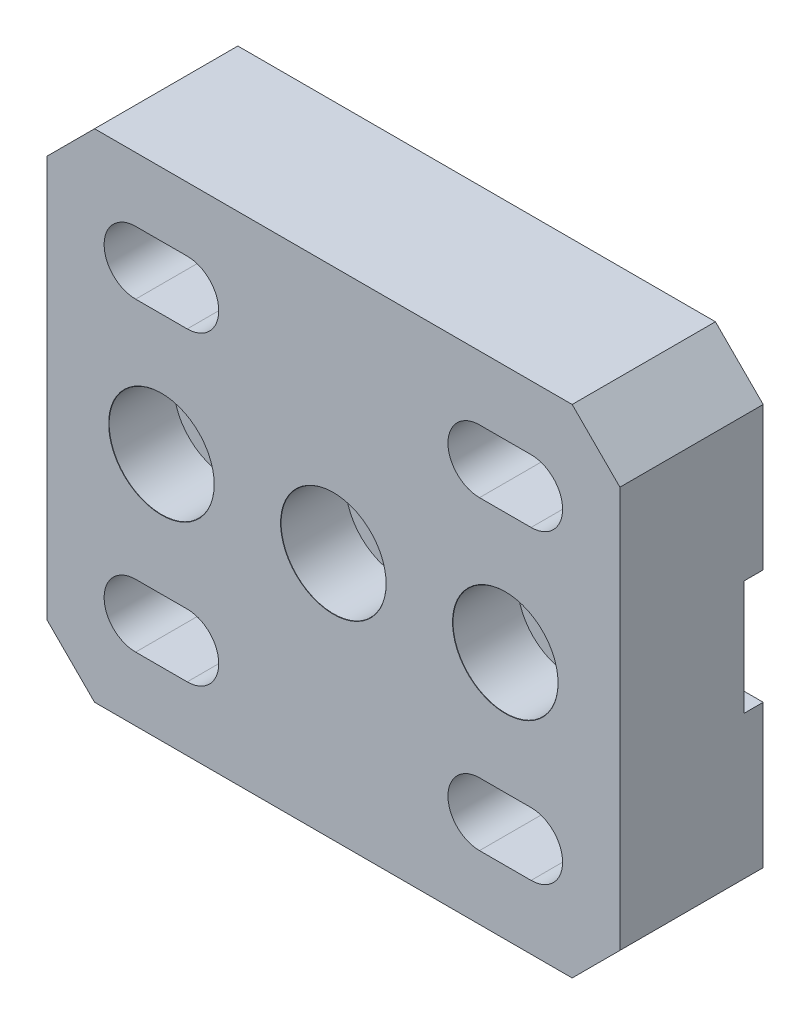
ISO-10303-21;
HEADER;
FILE_DESCRIPTION(('STEP AP214'),'2;1');
FILE_NAME('part.step','',(''),(''),'','','');
FILE_SCHEMA(('AUTOMOTIVE_DESIGN { 1 0 10303 214 1 1 1 1 }'));
ENDSEC;
DATA;
#1=APPLICATION_CONTEXT('core data for automotive mechanical design processes');
#2=APPLICATION_PROTOCOL_DEFINITION('international standard','automotive_design',2000,#1);
#3=PRODUCT_CONTEXT('',#1,'mechanical');
#4=PRODUCT('Part','Part','',(#3));
#5=PRODUCT_RELATED_PRODUCT_CATEGORY('part','',(#4));
#6=PRODUCT_DEFINITION_FORMATION('','',#4);
#7=PRODUCT_DEFINITION_CONTEXT('part definition',#1,'design');
#8=PRODUCT_DEFINITION('design','',#6,#7);
#9=PRODUCT_DEFINITION_SHAPE('','',#8);
#10=(LENGTH_UNIT() NAMED_UNIT(*) SI_UNIT(.MILLI.,.METRE.));
#11=(NAMED_UNIT(*) PLANE_ANGLE_UNIT() SI_UNIT($,.RADIAN.));
#12=(NAMED_UNIT(*) SI_UNIT($,.STERADIAN.) SOLID_ANGLE_UNIT());
#13=UNCERTAINTY_MEASURE_WITH_UNIT(LENGTH_MEASURE(1.E-05),#10,'distance_accuracy_value','');
#14=(GEOMETRIC_REPRESENTATION_CONTEXT(3) GLOBAL_UNCERTAINTY_ASSIGNED_CONTEXT((#13)) GLOBAL_UNIT_ASSIGNED_CONTEXT((#10,
#11,#12)) REPRESENTATION_CONTEXT('',''));
#15=CARTESIAN_POINT('',(0.,0.,0.));
#16=DIRECTION('',(0.,0.,1.));
#17=DIRECTION('',(1.,0.,0.));
#18=AXIS2_PLACEMENT_3D('',#15,#16,#17);
#19=CARTESIAN_POINT('',(0.,0.,15.));
#20=DIRECTION('',(0.,0.,1.));
#21=DIRECTION('',(1.,0.,0.));
#22=AXIS2_PLACEMENT_3D('',#19,#20,#21);
#23=PLANE('',#22);
#24=CARTESIAN_POINT('',(60.5014802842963,10.,15.));
#25=DIRECTION('',(0.,0.,-1.));
#26=DIRECTION('',(-1.,0.,0.));
#27=AXIS2_PLACEMENT_3D('',#24,#25,#26);
#28=CIRCLE('',#27,3.3);
#29=CARTESIAN_POINT('',(60.5014802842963,13.3,15.));
#30=VERTEX_POINT('',#29);
#31=CARTESIAN_POINT('',(60.5014802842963,6.7,15.));
#32=VERTEX_POINT('',#31);
#33=EDGE_CURVE('E350',#30,#32,#28,.T.);
#34=ORIENTED_EDGE('',*,*,#33,.T.);
#35=DIRECTION('',(1.,0.,0.));
#36=VECTOR('',#35,1.);
#37=CARTESIAN_POINT('',(55.1014802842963,6.7,15.));
#38=LINE('',#37,#36);
#39=CARTESIAN_POINT('',(55.1014802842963,6.7,15.));
#40=VERTEX_POINT('',#39);
#41=EDGE_CURVE('E1411',#40,#32,#38,.T.);
#42=ORIENTED_EDGE('',*,*,#41,.F.);
#43=CARTESIAN_POINT('',(55.1014802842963,10.,15.));
#44=DIRECTION('',(0.,0.,-1.));
#45=DIRECTION('',(-1.,0.,0.));
#46=AXIS2_PLACEMENT_3D('',#43,#44,#45);
#47=CIRCLE('',#46,3.3);
#48=CARTESIAN_POINT('',(55.1014802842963,13.3,15.));
#49=VERTEX_POINT('',#48);
#50=EDGE_CURVE('E333',#40,#49,#47,.T.);
#51=ORIENTED_EDGE('',*,*,#50,.T.);
#52=DIRECTION('',(1.,0.,0.));
#53=VECTOR('',#52,1.);
#54=CARTESIAN_POINT('',(55.1014802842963,13.3,15.));
#55=LINE('',#54,#53);
#56=EDGE_CURVE('E1407',#49,#30,#55,.T.);
#57=ORIENTED_EDGE('',*,*,#56,.T.);
#58=EDGE_LOOP('',(#34,#42,#51,#57));
#59=FACE_BOUND('',#58,.T.);
#60=DIRECTION('',(1.,0.,0.));
#61=VECTOR('',#60,1.);
#62=CARTESIAN_POINT('',(19.1014802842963,6.7,15.));
#63=LINE('',#62,#61);
#64=CARTESIAN_POINT('',(19.1014802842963,6.7,15.));
#65=VERTEX_POINT('',#64);
#66=CARTESIAN_POINT('',(24.5014802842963,6.7,15.));
#67=VERTEX_POINT('',#66);
#68=EDGE_CURVE('E368',#65,#67,#63,.T.);
#69=ORIENTED_EDGE('',*,*,#68,.F.);
#70=CARTESIAN_POINT('',(19.1014802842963,10.,15.));
#71=DIRECTION('',(0.,0.,-1.));
#72=DIRECTION('',(-1.,0.,0.));
#73=AXIS2_PLACEMENT_3D('',#70,#71,#72);
#74=CIRCLE('',#73,3.3);
#75=CARTESIAN_POINT('',(19.1014802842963,13.3,15.));
#76=VERTEX_POINT('',#75);
#77=EDGE_CURVE('E390',#65,#76,#74,.T.);
#78=ORIENTED_EDGE('',*,*,#77,.T.);
#79=DIRECTION('',(1.,0.,0.));
#80=VECTOR('',#79,1.);
#81=CARTESIAN_POINT('',(19.1014802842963,13.3,15.));
#82=LINE('',#81,#80);
#83=CARTESIAN_POINT('',(24.5014802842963,13.3,15.));
#84=VERTEX_POINT('',#83);
#85=EDGE_CURVE('E365',#76,#84,#82,.T.);
#86=ORIENTED_EDGE('',*,*,#85,.T.);
#87=CARTESIAN_POINT('',(24.5014802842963,10.,15.));
#88=DIRECTION('',(0.,0.,-1.));
#89=DIRECTION('',(-1.,0.,0.));
#90=AXIS2_PLACEMENT_3D('',#87,#88,#89);
#91=CIRCLE('',#90,3.3);
#92=EDGE_CURVE('E413',#84,#67,#91,.T.);
#93=ORIENTED_EDGE('',*,*,#92,.T.);
#94=EDGE_LOOP('',(#69,#78,#86,#93));
#95=FACE_BOUND('',#94,.T.);
#96=DIRECTION('',(1.,0.,0.));
#97=VECTOR('',#96,1.);
#98=CARTESIAN_POINT('',(55.1014802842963,-25.3,15.));
#99=LINE('',#98,#97);
#100=CARTESIAN_POINT('',(55.1014802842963,-25.3,15.));
#101=VERTEX_POINT('',#100);
#102=CARTESIAN_POINT('',(60.5014802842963,-25.3,15.));
#103=VERTEX_POINT('',#102);
#104=EDGE_CURVE('E432',#101,#103,#99,.T.);
#105=ORIENTED_EDGE('',*,*,#104,.F.);
#106=CARTESIAN_POINT('',(55.1014802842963,-22.,15.));
#107=DIRECTION('',(0.,0.,-1.));
#108=DIRECTION('',(-1.,0.,0.));
#109=AXIS2_PLACEMENT_3D('',#106,#107,#108);
#110=CIRCLE('',#109,3.3);
#111=CARTESIAN_POINT('',(55.1014802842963,-18.7,15.));
#112=VERTEX_POINT('',#111);
#113=EDGE_CURVE('E454',#101,#112,#110,.T.);
#114=ORIENTED_EDGE('',*,*,#113,.T.);
#115=DIRECTION('',(1.,0.,0.));
#116=VECTOR('',#115,1.);
#117=CARTESIAN_POINT('',(55.1014802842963,-18.7,15.));
#118=LINE('',#117,#116);
#119=CARTESIAN_POINT('',(60.5014802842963,-18.7,15.));
#120=VERTEX_POINT('',#119);
#121=EDGE_CURVE('E429',#112,#120,#118,.T.);
#122=ORIENTED_EDGE('',*,*,#121,.T.);
#123=CARTESIAN_POINT('',(60.5014802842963,-22.,15.));
#124=DIRECTION('',(0.,0.,-1.));
#125=DIRECTION('',(-1.,0.,0.));
#126=AXIS2_PLACEMENT_3D('',#123,#124,#125);
#127=CIRCLE('',#126,3.3);
#128=EDGE_CURVE('E477',#120,#103,#127,.T.);
#129=ORIENTED_EDGE('',*,*,#128,.T.);
#130=EDGE_LOOP('',(#105,#114,#122,#129));
#131=FACE_BOUND('',#130,.T.);
#132=CARTESIAN_POINT('',(57.8014802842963,-6.,15.));
#133=DIRECTION('',(0.,0.,1.));
#134=DIRECTION('',(1.,0.,0.));
#135=AXIS2_PLACEMENT_3D('',#132,#133,#134);
#136=CIRCLE('',#135,5.525);
#137=CARTESIAN_POINT('',(63.3264802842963,-6.,15.));
#138=VERTEX_POINT('',#137);
#139=EDGE_CURVE('E554',#138,#138,#136,.T.);
#140=ORIENTED_EDGE('',*,*,#139,.F.);
#141=EDGE_LOOP('',(#140));
#142=FACE_BOUND('',#141,.T.);
#143=CARTESIAN_POINT('',(39.8014802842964,-6.,15.));
#144=DIRECTION('',(0.,0.,1.));
#145=DIRECTION('',(1.,0.,0.));
#146=AXIS2_PLACEMENT_3D('',#143,#144,#145);
#147=CIRCLE('',#146,5.525);
#148=CARTESIAN_POINT('',(45.3264802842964,-6.,15.));
#149=VERTEX_POINT('',#148);
#150=EDGE_CURVE('E575',#149,#149,#147,.T.);
#151=ORIENTED_EDGE('',*,*,#150,.F.);
#152=EDGE_LOOP('',(#151));
#153=FACE_BOUND('',#152,.T.);
#154=CARTESIAN_POINT('',(21.8014802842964,-6.,15.));
#155=DIRECTION('',(0.,0.,1.));
#156=DIRECTION('',(1.,0.,0.));
#157=AXIS2_PLACEMENT_3D('',#154,#155,#156);
#158=CIRCLE('',#157,5.525);
#159=CARTESIAN_POINT('',(27.3264802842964,-6.,15.));
#160=VERTEX_POINT('',#159);
#161=EDGE_CURVE('E596',#160,#160,#158,.T.);
#162=ORIENTED_EDGE('',*,*,#161,.F.);
#163=EDGE_LOOP('',(#162));
#164=FACE_BOUND('',#163,.T.);
#165=DIRECTION('',(-1.,0.,0.));
#166=VECTOR('',#165,1.);
#167=CARTESIAN_POINT('',(9.80148028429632,20.,15.));
#168=LINE('',#167,#166);
#169=CARTESIAN_POINT('',(64.8014802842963,20.,15.));
#170=VERTEX_POINT('',#169);
#171=CARTESIAN_POINT('',(14.8014802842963,20.,15.));
#172=VERTEX_POINT('',#171);
#173=EDGE_CURVE('E652',#170,#172,#168,.T.);
#174=ORIENTED_EDGE('',*,*,#173,.T.);
#175=DIRECTION('',(0.707106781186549,0.707106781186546,0.));
#176=VECTOR('',#175,1.);
#177=CARTESIAN_POINT('',(-2.59925985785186,2.59925985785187,15.));
#178=LINE('',#177,#176);
#179=CARTESIAN_POINT('',(9.80148028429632,15.,15.));
#180=VERTEX_POINT('',#179);
#181=EDGE_CURVE('E684',#172,#180,#178,.F.);
#182=ORIENTED_EDGE('',*,*,#181,.T.);
#183=DIRECTION('',(0.,-1.,0.));
#184=VECTOR('',#183,1.);
#185=CARTESIAN_POINT('',(9.80148028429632,20.,15.));
#186=LINE('',#185,#184);
#187=CARTESIAN_POINT('',(9.80148028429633,-27.,15.));
#188=VERTEX_POINT('',#187);
#189=EDGE_CURVE('E642',#180,#188,#186,.T.);
#190=ORIENTED_EDGE('',*,*,#189,.T.);
#191=DIRECTION('',(-0.707106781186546,0.707106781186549,0.));
#192=VECTOR('',#191,1.);
#193=CARTESIAN_POINT('',(-8.59925985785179,-8.59925985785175,15.));
#194=LINE('',#193,#192);
#195=CARTESIAN_POINT('',(14.8014802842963,-32.,15.));
#196=VERTEX_POINT('',#195);
#197=EDGE_CURVE('E680',#188,#196,#194,.F.);
#198=ORIENTED_EDGE('',*,*,#197,.T.);
#199=DIRECTION('',(1.,0.,0.));
#200=VECTOR('',#199,1.);
#201=CARTESIAN_POINT('',(9.80148028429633,-32.,15.));
#202=LINE('',#201,#200);
#203=CARTESIAN_POINT('',(64.8014802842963,-32.,15.));
#204=VERTEX_POINT('',#203);
#205=EDGE_CURVE('E645',#196,#204,#202,.T.);
#206=ORIENTED_EDGE('',*,*,#205,.T.);
#207=DIRECTION('',(-0.70710678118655,-0.707106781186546,0.));
#208=VECTOR('',#207,1.);
#209=CARTESIAN_POINT('',(48.400740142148,-48.4007401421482,15.));
#210=LINE('',#209,#208);
#211=CARTESIAN_POINT('',(69.8014802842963,-27.,15.));
#212=VERTEX_POINT('',#211);
#213=EDGE_CURVE('E678',#204,#212,#210,.F.);
#214=ORIENTED_EDGE('',*,*,#213,.T.);
#215=DIRECTION('',(0.,1.,0.));
#216=VECTOR('',#215,1.);
#217=CARTESIAN_POINT('',(69.8014802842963,20.,15.));
#218=LINE('',#217,#216);
#219=CARTESIAN_POINT('',(69.8014802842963,15.,15.));
#220=VERTEX_POINT('',#219);
#221=EDGE_CURVE('E649',#212,#220,#218,.T.);
#222=ORIENTED_EDGE('',*,*,#221,.T.);
#223=DIRECTION('',(0.707106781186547,-0.707106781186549,0.));
#224=VECTOR('',#223,1.);
#225=CARTESIAN_POINT('',(42.4007401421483,42.4007401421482,15.));
#226=LINE('',#225,#224);
#227=EDGE_CURVE('E682',#220,#170,#226,.F.);
#228=ORIENTED_EDGE('',*,*,#227,.T.);
#229=EDGE_LOOP('',(#174,#182,#190,#198,#206,#214,#222,#228));
#230=FACE_BOUND('',#229,.T.);
#231=CARTESIAN_POINT('',(19.1014802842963,-22.,15.));
#232=DIRECTION('',(0.,0.,-1.));
#233=DIRECTION('',(-1.,0.,0.));
#234=AXIS2_PLACEMENT_3D('',#231,#232,#233);
#235=CIRCLE('',#234,3.3);
#236=CARTESIAN_POINT('',(19.1014802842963,-25.3,15.));
#237=VERTEX_POINT('',#236);
#238=CARTESIAN_POINT('',(19.1014802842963,-18.7,15.));
#239=VERTEX_POINT('',#238);
#240=EDGE_CURVE('E519',#237,#239,#235,.T.);
#241=ORIENTED_EDGE('',*,*,#240,.T.);
#242=DIRECTION('',(1.,0.,0.));
#243=VECTOR('',#242,1.);
#244=CARTESIAN_POINT('',(19.1014802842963,-18.7,15.));
#245=LINE('',#244,#243);
#246=CARTESIAN_POINT('',(24.5014802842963,-18.7,15.));
#247=VERTEX_POINT('',#246);
#248=EDGE_CURVE('E493',#239,#247,#245,.T.);
#249=ORIENTED_EDGE('',*,*,#248,.T.);
#250=CARTESIAN_POINT('',(24.5014802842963,-22.,15.));
#251=DIRECTION('',(0.,0.,-1.));
#252=DIRECTION('',(-1.,0.,0.));
#253=AXIS2_PLACEMENT_3D('',#250,#251,#252);
#254=CIRCLE('',#253,3.3);
#255=CARTESIAN_POINT('',(24.5014802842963,-25.3,15.));
#256=VERTEX_POINT('',#255);
#257=EDGE_CURVE('E543',#247,#256,#254,.T.);
#258=ORIENTED_EDGE('',*,*,#257,.T.);
#259=DIRECTION('',(1.,0.,0.));
#260=VECTOR('',#259,1.);
#261=CARTESIAN_POINT('',(19.1014802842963,-25.3,15.));
#262=LINE('',#261,#260);
#263=EDGE_CURVE('E496',#237,#256,#262,.T.);
#264=ORIENTED_EDGE('',*,*,#263,.F.);
#265=EDGE_LOOP('',(#241,#249,#258,#264));
#266=FACE_BOUND('',#265,.T.);
#267=ADVANCED_FACE('F16',(#59,#95,#131,#142,#153,#164,#230,#266),#23,.T.);
#268=CARTESIAN_POINT('',(0.,0.,0.));
#269=DIRECTION('',(0.,0.,1.));
#270=DIRECTION('',(1.,0.,0.));
#271=AXIS2_PLACEMENT_3D('',#268,#269,#270);
#272=PLANE('',#271);
#273=CARTESIAN_POINT('',(55.1014802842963,10.,0.));
#274=DIRECTION('',(0.,0.,-1.));
#275=DIRECTION('',(-1.,0.,0.));
#276=AXIS2_PLACEMENT_3D('',#273,#274,#275);
#277=CIRCLE('',#276,5.5);
#278=CARTESIAN_POINT('',(55.1014802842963,4.5,0.));
#279=VERTEX_POINT('',#278);
#280=CARTESIAN_POINT('',(55.1014802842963,15.5,0.));
#281=VERTEX_POINT('',#280);
#282=EDGE_CURVE('E313',#279,#281,#277,.T.);
#283=ORIENTED_EDGE('',*,*,#282,.F.);
#284=DIRECTION('',(1.,0.,0.));
#285=VECTOR('',#284,1.);
#286=CARTESIAN_POINT('',(55.1014802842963,4.5,0.));
#287=LINE('',#286,#285);
#288=CARTESIAN_POINT('',(60.5014802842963,4.5,0.));
#289=VERTEX_POINT('',#288);
#290=EDGE_CURVE('E296',#279,#289,#287,.T.);
#291=ORIENTED_EDGE('',*,*,#290,.T.);
#292=CARTESIAN_POINT('',(60.5014802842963,10.,0.));
#293=DIRECTION('',(0.,0.,-1.));
#294=DIRECTION('',(-1.,0.,0.));
#295=AXIS2_PLACEMENT_3D('',#292,#293,#294);
#296=CIRCLE('',#295,5.5);
#297=CARTESIAN_POINT('',(60.5014802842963,15.5,0.));
#298=VERTEX_POINT('',#297);
#299=EDGE_CURVE('E342',#298,#289,#296,.T.);
#300=ORIENTED_EDGE('',*,*,#299,.F.);
#301=DIRECTION('',(1.,0.,0.));
#302=VECTOR('',#301,1.);
#303=CARTESIAN_POINT('',(55.1014802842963,15.5,0.));
#304=LINE('',#303,#302);
#305=EDGE_CURVE('E323',#281,#298,#304,.T.);
#306=ORIENTED_EDGE('',*,*,#305,.F.);
#307=EDGE_LOOP('',(#283,#291,#300,#306));
#308=FACE_BOUND('',#307,.T.);
#309=CARTESIAN_POINT('',(19.1014802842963,10.,0.));
#310=DIRECTION('',(0.,0.,-1.));
#311=DIRECTION('',(-1.,0.,0.));
#312=AXIS2_PLACEMENT_3D('',#309,#310,#311);
#313=CIRCLE('',#312,5.5);
#314=CARTESIAN_POINT('',(19.1014802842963,4.5,0.));
#315=VERTEX_POINT('',#314);
#316=CARTESIAN_POINT('',(19.1014802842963,15.5,0.));
#317=VERTEX_POINT('',#316);
#318=EDGE_CURVE('E382',#315,#317,#313,.T.);
#319=ORIENTED_EDGE('',*,*,#318,.F.);
#320=DIRECTION('',(1.,0.,0.));
#321=VECTOR('',#320,1.);
#322=CARTESIAN_POINT('',(19.1014802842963,4.5,0.));
#323=LINE('',#322,#321);
#324=CARTESIAN_POINT('',(24.5014802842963,4.5,0.));
#325=VERTEX_POINT('',#324);
#326=EDGE_CURVE('E374',#315,#325,#323,.T.);
#327=ORIENTED_EDGE('',*,*,#326,.T.);
#328=CARTESIAN_POINT('',(24.5014802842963,10.,0.));
#329=DIRECTION('',(0.,0.,-1.));
#330=DIRECTION('',(-1.,0.,0.));
#331=AXIS2_PLACEMENT_3D('',#328,#329,#330);
#332=CIRCLE('',#331,5.5);
#333=CARTESIAN_POINT('',(24.5014802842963,15.5,0.));
#334=VERTEX_POINT('',#333);
#335=EDGE_CURVE('E404',#334,#325,#332,.T.);
#336=ORIENTED_EDGE('',*,*,#335,.F.);
#337=DIRECTION('',(1.,0.,0.));
#338=VECTOR('',#337,1.);
#339=CARTESIAN_POINT('',(19.1014802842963,15.5,0.));
#340=LINE('',#339,#338);
#341=EDGE_CURVE('E357',#317,#334,#340,.T.);
#342=ORIENTED_EDGE('',*,*,#341,.F.);
#343=EDGE_LOOP('',(#319,#327,#336,#342));
#344=FACE_BOUND('',#343,.T.);
#345=DIRECTION('',(0.,-1.,0.));
#346=VECTOR('',#345,1.);
#347=CARTESIAN_POINT('',(9.80148028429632,20.,0.));
#348=LINE('',#347,#346);
#349=CARTESIAN_POINT('',(9.80148028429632,15.,0.));
#350=VERTEX_POINT('',#349);
#351=CARTESIAN_POINT('',(9.80148028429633,0.,0.));
#352=VERTEX_POINT('',#351);
#353=EDGE_CURVE('E656',#350,#352,#348,.T.);
#354=ORIENTED_EDGE('',*,*,#353,.F.);
#355=DIRECTION('',(-0.707106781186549,-0.707106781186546,0.));
#356=VECTOR('',#355,1.);
#357=CARTESIAN_POINT('',(9.80148028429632,15.,0.));
#358=LINE('',#357,#356);
#359=CARTESIAN_POINT('',(14.8014802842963,20.,0.));
#360=VERTEX_POINT('',#359);
#361=EDGE_CURVE('E671',#350,#360,#358,.F.);
#362=ORIENTED_EDGE('',*,*,#361,.T.);
#363=DIRECTION('',(-1.,0.,0.));
#364=VECTOR('',#363,1.);
#365=CARTESIAN_POINT('',(9.80148028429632,20.,0.));
#366=LINE('',#365,#364);
#367=CARTESIAN_POINT('',(64.8014802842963,20.,0.));
#368=VERTEX_POINT('',#367);
#369=EDGE_CURVE('E646',#368,#360,#366,.T.);
#370=ORIENTED_EDGE('',*,*,#369,.F.);
#371=DIRECTION('',(-0.707106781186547,0.707106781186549,0.));
#372=VECTOR('',#371,1.);
#373=CARTESIAN_POINT('',(64.8014802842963,20.,0.));
#374=LINE('',#373,#372);
#375=CARTESIAN_POINT('',(69.8014802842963,15.,0.));
#376=VERTEX_POINT('',#375);
#377=EDGE_CURVE('E669',#368,#376,#374,.F.);
#378=ORIENTED_EDGE('',*,*,#377,.T.);
#379=DIRECTION('',(0.,1.,0.));
#380=VECTOR('',#379,1.);
#381=CARTESIAN_POINT('',(69.8014802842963,20.,0.));
#382=LINE('',#381,#380);
#383=CARTESIAN_POINT('',(69.8014802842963,0.,0.));
#384=VERTEX_POINT('',#383);
#385=EDGE_CURVE('E660',#384,#376,#382,.T.);
#386=ORIENTED_EDGE('',*,*,#385,.F.);
#387=DIRECTION('',(-1.,0.,0.));
#388=VECTOR('',#387,1.);
#389=CARTESIAN_POINT('',(69.8014802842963,0.,0.));
#390=LINE('',#389,#388);
#391=EDGE_CURVE('E633',#384,#352,#390,.T.);
#392=ORIENTED_EDGE('',*,*,#391,.T.);
#393=EDGE_LOOP('',(#354,#362,#370,#378,#386,#392));
#394=FACE_BOUND('',#393,.T.);
#395=ADVANCED_FACE('F321',(#308,#344,#394),#272,.F.);
#396=CARTESIAN_POINT('',(9.80148028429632,20.,15.));
#397=DIRECTION('',(1.,0.,0.));
#398=DIRECTION('',(0.,1.,0.));
#399=AXIS2_PLACEMENT_3D('',#396,#397,#398);
#400=PLANE('',#399);
#401=ORIENTED_EDGE('',*,*,#189,.F.);
#402=DIRECTION('',(0.,0.,-1.));
#403=VECTOR('',#402,1.);
#404=CARTESIAN_POINT('',(9.80148028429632,15.,15.));
#405=LINE('',#404,#403);
#406=EDGE_CURVE('E666',#180,#350,#405,.T.);
#407=ORIENTED_EDGE('',*,*,#406,.T.);
#408=ORIENTED_EDGE('',*,*,#353,.T.);
#409=DIRECTION('',(0.,0.,-1.));
#410=VECTOR('',#409,1.);
#411=CARTESIAN_POINT('',(9.80148028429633,0.,0.));
#412=LINE('',#411,#410);
#413=CARTESIAN_POINT('',(9.80148028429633,0.,2.));
#414=VERTEX_POINT('',#413);
#415=EDGE_CURVE('E619',#414,#352,#412,.T.);
#416=ORIENTED_EDGE('',*,*,#415,.F.);
#417=DIRECTION('',(0.,1.,0.));
#418=VECTOR('',#417,1.);
#419=CARTESIAN_POINT('',(9.80148028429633,0.,2.));
#420=LINE('',#419,#418);
#421=CARTESIAN_POINT('',(9.80148028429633,-12.,2.));
#422=VERTEX_POINT('',#421);
#423=EDGE_CURVE('E628',#422,#414,#420,.T.);
#424=ORIENTED_EDGE('',*,*,#423,.F.);
#425=DIRECTION('',(0.,0.,1.));
#426=VECTOR('',#425,1.);
#427=CARTESIAN_POINT('',(9.80148028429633,-12.,0.));
#428=LINE('',#427,#426);
#429=CARTESIAN_POINT('',(9.80148028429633,-12.,0.));
#430=VERTEX_POINT('',#429);
#431=EDGE_CURVE('E614',#430,#422,#428,.T.);
#432=ORIENTED_EDGE('',*,*,#431,.F.);
#433=CARTESIAN_POINT('',(9.80148028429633,-27.,0.));
#434=VERTEX_POINT('',#433);
#435=EDGE_CURVE('E636',#430,#434,#348,.T.);
#436=ORIENTED_EDGE('',*,*,#435,.T.);
#437=DIRECTION('',(0.,0.,1.));
#438=VECTOR('',#437,1.);
#439=CARTESIAN_POINT('',(9.80148028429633,-27.,15.));
#440=LINE('',#439,#438);
#441=EDGE_CURVE('E655',#434,#188,#440,.T.);
#442=ORIENTED_EDGE('',*,*,#441,.T.);
#443=EDGE_LOOP('',(#401,#407,#408,#416,#424,#432,#436,#442));
#444=FACE_BOUND('',#443,.T.);
#445=ADVANCED_FACE('F706',(#444),#400,.F.);
#446=CARTESIAN_POINT('',(9.80148028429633,-32.,15.));
#447=DIRECTION('',(0.,1.,0.));
#448=DIRECTION('',(0.,0.,1.));
#449=AXIS2_PLACEMENT_3D('',#446,#447,#448);
#450=PLANE('',#449);
#451=ORIENTED_EDGE('',*,*,#205,.F.);
#452=DIRECTION('',(0.,0.,-1.));
#453=VECTOR('',#452,1.);
#454=CARTESIAN_POINT('',(14.8014802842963,-32.,15.));
#455=LINE('',#454,#453);
#456=CARTESIAN_POINT('',(14.8014802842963,-32.,0.));
#457=VERTEX_POINT('',#456);
#458=EDGE_CURVE('E693',#196,#457,#455,.T.);
#459=ORIENTED_EDGE('',*,*,#458,.T.);
#460=DIRECTION('',(1.,0.,0.));
#461=VECTOR('',#460,1.);
#462=CARTESIAN_POINT('',(9.80148028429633,-32.,0.));
#463=LINE('',#462,#461);
#464=CARTESIAN_POINT('',(64.8014802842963,-32.,0.));
#465=VERTEX_POINT('',#464);
#466=EDGE_CURVE('E658',#457,#465,#463,.T.);
#467=ORIENTED_EDGE('',*,*,#466,.T.);
#468=DIRECTION('',(0.,0.,1.));
#469=VECTOR('',#468,1.);
#470=CARTESIAN_POINT('',(64.8014802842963,-32.,15.));
#471=LINE('',#470,#469);
#472=EDGE_CURVE('E691',#465,#204,#471,.T.);
#473=ORIENTED_EDGE('',*,*,#472,.T.);
#474=EDGE_LOOP('',(#451,#459,#467,#473));
#475=FACE_BOUND('',#474,.T.);
#476=ADVANCED_FACE('F696',(#475),#450,.F.);
#477=CARTESIAN_POINT('',(69.8014802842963,20.,15.));
#478=DIRECTION('',(-1.,0.,0.));
#479=DIRECTION('',(0.,0.,1.));
#480=AXIS2_PLACEMENT_3D('',#477,#478,#479);
#481=PLANE('',#480);
#482=ORIENTED_EDGE('',*,*,#385,.T.);
#483=DIRECTION('',(0.,0.,1.));
#484=VECTOR('',#483,1.);
#485=CARTESIAN_POINT('',(69.8014802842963,15.,15.));
#486=LINE('',#485,#484);
#487=EDGE_CURVE('E689',#376,#220,#486,.T.);
#488=ORIENTED_EDGE('',*,*,#487,.T.);
#489=ORIENTED_EDGE('',*,*,#221,.F.);
#490=DIRECTION('',(0.,0.,-1.));
#491=VECTOR('',#490,1.);
#492=CARTESIAN_POINT('',(69.8014802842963,-27.,15.));
#493=LINE('',#492,#491);
#494=CARTESIAN_POINT('',(69.8014802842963,-27.,0.));
#495=VERTEX_POINT('',#494);
#496=EDGE_CURVE('E686',#212,#495,#493,.T.);
#497=ORIENTED_EDGE('',*,*,#496,.T.);
#498=CARTESIAN_POINT('',(69.8014802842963,-12.,0.));
#499=VERTEX_POINT('',#498);
#500=EDGE_CURVE('E661',#495,#499,#382,.T.);
#501=ORIENTED_EDGE('',*,*,#500,.T.);
#502=DIRECTION('',(0.,0.,1.));
#503=VECTOR('',#502,1.);
#504=CARTESIAN_POINT('',(69.8014802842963,-12.,0.));
#505=LINE('',#504,#503);
#506=CARTESIAN_POINT('',(69.8014802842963,-12.,2.));
#507=VERTEX_POINT('',#506);
#508=EDGE_CURVE('E615',#499,#507,#505,.T.);
#509=ORIENTED_EDGE('',*,*,#508,.T.);
#510=DIRECTION('',(0.,1.,0.));
#511=VECTOR('',#510,1.);
#512=CARTESIAN_POINT('',(69.8014802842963,0.,2.));
#513=LINE('',#512,#511);
#514=CARTESIAN_POINT('',(69.8014802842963,0.,2.));
#515=VERTEX_POINT('',#514);
#516=EDGE_CURVE('E618',#507,#515,#513,.T.);
#517=ORIENTED_EDGE('',*,*,#516,.T.);
#518=DIRECTION('',(0.,0.,-1.));
#519=VECTOR('',#518,1.);
#520=CARTESIAN_POINT('',(69.8014802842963,0.,0.));
#521=LINE('',#520,#519);
#522=EDGE_CURVE('E622',#515,#384,#521,.T.);
#523=ORIENTED_EDGE('',*,*,#522,.T.);
#524=EDGE_LOOP('',(#482,#488,#489,#497,#501,#509,#517,#523));
#525=FACE_BOUND('',#524,.T.);
#526=ADVANCED_FACE('F731',(#525),#481,.F.);
#527=CARTESIAN_POINT('',(9.80148028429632,20.,15.));
#528=DIRECTION('',(0.,-1.,0.));
#529=DIRECTION('',(1.,0.,0.));
#530=AXIS2_PLACEMENT_3D('',#527,#528,#529);
#531=PLANE('',#530);
#532=ORIENTED_EDGE('',*,*,#369,.T.);
#533=DIRECTION('',(0.,0.,1.));
#534=VECTOR('',#533,1.);
#535=CARTESIAN_POINT('',(14.8014802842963,20.,15.));
#536=LINE('',#535,#534);
#537=EDGE_CURVE('E676',#360,#172,#536,.T.);
#538=ORIENTED_EDGE('',*,*,#537,.T.);
#539=ORIENTED_EDGE('',*,*,#173,.F.);
#540=DIRECTION('',(0.,0.,-1.));
#541=VECTOR('',#540,1.);
#542=CARTESIAN_POINT('',(64.8014802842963,20.,15.));
#543=LINE('',#542,#541);
#544=EDGE_CURVE('E673',#170,#368,#543,.T.);
#545=ORIENTED_EDGE('',*,*,#544,.T.);
#546=EDGE_LOOP('',(#532,#538,#539,#545));
#547=FACE_BOUND('',#546,.T.);
#548=ADVANCED_FACE('F721',(#547),#531,.F.);
#549=CARTESIAN_POINT('',(55.1014802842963,-22.,0.));
#550=DIRECTION('',(0.,0.,-1.));
#551=DIRECTION('',(-1.,0.,0.));
#552=AXIS2_PLACEMENT_3D('',#549,#550,#551);
#553=CIRCLE('',#552,5.5);
#554=CARTESIAN_POINT('',(55.1014802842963,-27.5,0.));
#555=VERTEX_POINT('',#554);
#556=CARTESIAN_POINT('',(55.1014802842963,-16.5,0.));
#557=VERTEX_POINT('',#556);
#558=EDGE_CURVE('E446',#555,#557,#553,.T.);
#559=ORIENTED_EDGE('',*,*,#558,.F.);
#560=DIRECTION('',(1.,0.,0.));
#561=VECTOR('',#560,1.);
#562=CARTESIAN_POINT('',(55.1014802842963,-27.5,0.));
#563=LINE('',#562,#561);
#564=CARTESIAN_POINT('',(60.5014802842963,-27.5,0.));
#565=VERTEX_POINT('',#564);
#566=EDGE_CURVE('E438',#555,#565,#563,.T.);
#567=ORIENTED_EDGE('',*,*,#566,.T.);
#568=CARTESIAN_POINT('',(60.5014802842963,-22.,0.));
#569=DIRECTION('',(0.,0.,-1.));
#570=DIRECTION('',(-1.,0.,0.));
#571=AXIS2_PLACEMENT_3D('',#568,#569,#570);
#572=CIRCLE('',#571,5.5);
#573=CARTESIAN_POINT('',(60.5014802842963,-16.5,0.));
#574=VERTEX_POINT('',#573);
#575=EDGE_CURVE('E468',#574,#565,#572,.T.);
#576=ORIENTED_EDGE('',*,*,#575,.F.);
#577=DIRECTION('',(1.,0.,0.));
#578=VECTOR('',#577,1.);
#579=CARTESIAN_POINT('',(55.1014802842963,-16.5,0.));
#580=LINE('',#579,#578);
#581=EDGE_CURVE('E421',#557,#574,#580,.T.);
#582=ORIENTED_EDGE('',*,*,#581,.F.);
#583=EDGE_LOOP('',(#559,#567,#576,#582));
#584=FACE_BOUND('',#583,.T.);
#585=DIRECTION('',(1.,0.,0.));
#586=VECTOR('',#585,1.);
#587=CARTESIAN_POINT('',(19.1014802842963,-27.5,0.));
#588=LINE('',#587,#586);
#589=CARTESIAN_POINT('',(19.1014802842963,-27.5,0.));
#590=VERTEX_POINT('',#589);
#591=CARTESIAN_POINT('',(24.5014802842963,-27.5,0.));
#592=VERTEX_POINT('',#591);
#593=EDGE_CURVE('E502',#590,#592,#588,.T.);
#594=ORIENTED_EDGE('',*,*,#593,.T.);
#595=CARTESIAN_POINT('',(24.5014802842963,-22.,0.));
#596=DIRECTION('',(0.,0.,-1.));
#597=DIRECTION('',(-1.,0.,0.));
#598=AXIS2_PLACEMENT_3D('',#595,#596,#597);
#599=CIRCLE('',#598,5.5);
#600=CARTESIAN_POINT('',(24.5014802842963,-16.5,0.));
#601=VERTEX_POINT('',#600);
#602=EDGE_CURVE('E534',#601,#592,#599,.T.);
#603=ORIENTED_EDGE('',*,*,#602,.F.);
#604=DIRECTION('',(1.,0.,0.));
#605=VECTOR('',#604,1.);
#606=CARTESIAN_POINT('',(19.1014802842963,-16.5,0.));
#607=LINE('',#606,#605);
#608=CARTESIAN_POINT('',(19.1014802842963,-16.5,0.));
#609=VERTEX_POINT('',#608);
#610=EDGE_CURVE('E485',#609,#601,#607,.T.);
#611=ORIENTED_EDGE('',*,*,#610,.F.);
#612=CARTESIAN_POINT('',(19.1014802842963,-22.,0.));
#613=DIRECTION('',(0.,0.,-1.));
#614=DIRECTION('',(-1.,0.,0.));
#615=AXIS2_PLACEMENT_3D('',#612,#613,#614);
#616=CIRCLE('',#615,5.5);
#617=EDGE_CURVE('E511',#590,#609,#616,.T.);
#618=ORIENTED_EDGE('',*,*,#617,.F.);
#619=EDGE_LOOP('',(#594,#603,#611,#618));
#620=FACE_BOUND('',#619,.T.);
#621=ORIENTED_EDGE('',*,*,#466,.F.);
#622=DIRECTION('',(0.707106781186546,-0.707106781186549,0.));
#623=VECTOR('',#622,1.);
#624=CARTESIAN_POINT('',(14.8014802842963,-32.,0.));
#625=LINE('',#624,#623);
#626=EDGE_CURVE('E11',#457,#434,#625,.F.);
#627=ORIENTED_EDGE('',*,*,#626,.T.);
#628=ORIENTED_EDGE('',*,*,#435,.F.);
#629=DIRECTION('',(-1.,0.,0.));
#630=VECTOR('',#629,1.);
#631=CARTESIAN_POINT('',(69.8014802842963,-12.,0.));
#632=LINE('',#631,#630);
#633=EDGE_CURVE('E625',#499,#430,#632,.T.);
#634=ORIENTED_EDGE('',*,*,#633,.F.);
#635=ORIENTED_EDGE('',*,*,#500,.F.);
#636=DIRECTION('',(0.70710678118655,0.707106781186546,0.));
#637=VECTOR('',#636,1.);
#638=CARTESIAN_POINT('',(69.8014802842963,-27.,0.));
#639=LINE('',#638,#637);
#640=EDGE_CURVE('E24',#495,#465,#639,.F.);
#641=ORIENTED_EDGE('',*,*,#640,.T.);
#642=EDGE_LOOP('',(#621,#627,#628,#634,#635,#641));
#643=FACE_BOUND('',#642,.T.);
#644=ADVANCED_FACE('F699',(#584,#620,#643),#272,.F.);
#645=CARTESIAN_POINT('',(69.8014802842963,0.,0.));
#646=DIRECTION('',(0.,1.,0.));
#647=DIRECTION('',(0.,0.,1.));
#648=AXIS2_PLACEMENT_3D('',#645,#646,#647);
#649=PLANE('',#648);
#650=ORIENTED_EDGE('',*,*,#415,.T.);
#651=ORIENTED_EDGE('',*,*,#391,.F.);
#652=ORIENTED_EDGE('',*,*,#522,.F.);
#653=DIRECTION('',(-1.,0.,0.));
#654=VECTOR('',#653,1.);
#655=CARTESIAN_POINT('',(69.8014802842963,0.,2.));
#656=LINE('',#655,#654);
#657=EDGE_CURVE('E637',#515,#414,#656,.T.);
#658=ORIENTED_EDGE('',*,*,#657,.T.);
#659=EDGE_LOOP('',(#650,#651,#652,#658));
#660=FACE_BOUND('',#659,.T.);
#661=ADVANCED_FACE('F736',(#660),#649,.F.);
#662=CARTESIAN_POINT('',(69.8014802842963,0.,2.));
#663=DIRECTION('',(0.,0.,1.));
#664=DIRECTION('',(0.,-1.,0.));
#665=AXIS2_PLACEMENT_3D('',#662,#663,#664);
#666=PLANE('',#665);
#667=CARTESIAN_POINT('',(57.8014802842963,-6.,2.));
#668=DIRECTION('',(0.,0.,1.));
#669=DIRECTION('',(1.,0.,0.));
#670=AXIS2_PLACEMENT_3D('',#667,#668,#669);
#671=CIRCLE('',#670,3.325);
#672=CARTESIAN_POINT('',(61.1264802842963,-6.,2.));
#673=VERTEX_POINT('',#672);
#674=EDGE_CURVE('E551',#673,#673,#671,.T.);
#675=ORIENTED_EDGE('',*,*,#674,.T.);
#676=EDGE_LOOP('',(#675));
#677=FACE_BOUND('',#676,.T.);
#678=CARTESIAN_POINT('',(39.8014802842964,-6.,2.));
#679=DIRECTION('',(0.,0.,1.));
#680=DIRECTION('',(1.,0.,0.));
#681=AXIS2_PLACEMENT_3D('',#678,#679,#680);
#682=CIRCLE('',#681,3.325);
#683=CARTESIAN_POINT('',(43.1264802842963,-6.,2.));
#684=VERTEX_POINT('',#683);
#685=EDGE_CURVE('E572',#684,#684,#682,.T.);
#686=ORIENTED_EDGE('',*,*,#685,.T.);
#687=EDGE_LOOP('',(#686));
#688=FACE_BOUND('',#687,.T.);
#689=CARTESIAN_POINT('',(21.8014802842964,-6.,2.));
#690=DIRECTION('',(0.,0.,1.));
#691=DIRECTION('',(1.,0.,0.));
#692=AXIS2_PLACEMENT_3D('',#689,#690,#691);
#693=CIRCLE('',#692,3.325);
#694=CARTESIAN_POINT('',(25.1264802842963,-6.,2.));
#695=VERTEX_POINT('',#694);
#696=EDGE_CURVE('E593',#695,#695,#693,.T.);
#697=ORIENTED_EDGE('',*,*,#696,.T.);
#698=EDGE_LOOP('',(#697));
#699=FACE_BOUND('',#698,.T.);
#700=ORIENTED_EDGE('',*,*,#423,.T.);
#701=ORIENTED_EDGE('',*,*,#657,.F.);
#702=ORIENTED_EDGE('',*,*,#516,.F.);
#703=DIRECTION('',(-1.,0.,0.));
#704=VECTOR('',#703,1.);
#705=CARTESIAN_POINT('',(69.8014802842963,-12.,2.));
#706=LINE('',#705,#704);
#707=EDGE_CURVE('E639',#507,#422,#706,.T.);
#708=ORIENTED_EDGE('',*,*,#707,.T.);
#709=EDGE_LOOP('',(#700,#701,#702,#708));
#710=FACE_BOUND('',#709,.T.);
#711=ADVANCED_FACE('F739',(#677,#688,#699,#710),#666,.F.);
#712=CARTESIAN_POINT('',(69.8014802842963,-12.,0.));
#713=DIRECTION('',(0.,-1.,0.));
#714=DIRECTION('',(1.,0.,0.));
#715=AXIS2_PLACEMENT_3D('',#712,#713,#714);
#716=PLANE('',#715);
#717=ORIENTED_EDGE('',*,*,#431,.T.);
#718=ORIENTED_EDGE('',*,*,#707,.F.);
#719=ORIENTED_EDGE('',*,*,#508,.F.);
#720=ORIENTED_EDGE('',*,*,#633,.T.);
#721=EDGE_LOOP('',(#717,#718,#719,#720));
#722=FACE_BOUND('',#721,.T.);
#723=ADVANCED_FACE('F742',(#722),#716,.F.);
#724=CARTESIAN_POINT('',(21.8014802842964,-6.,2.025));
#725=DIRECTION('',(0.,0.,-1.));
#726=DIRECTION('',(-1.,0.,0.));
#727=AXIS2_PLACEMENT_3D('',#724,#725,#726);
#728=CONICAL_SURFACE('',#727,3.3,0.785398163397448);
#729=ORIENTED_EDGE('',*,*,#696,.F.);
#730=EDGE_LOOP('',(#729));
#731=FACE_BOUND('',#730,.T.);
#732=CARTESIAN_POINT('',(21.8014802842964,-6.,2.025));
#733=DIRECTION('',(0.,0.,1.));
#734=DIRECTION('',(1.,0.,0.));
#735=AXIS2_PLACEMENT_3D('',#732,#733,#734);
#736=CIRCLE('',#735,3.3);
#737=CARTESIAN_POINT('',(25.1014802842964,-6.,2.025));
#738=VERTEX_POINT('',#737);
#739=EDGE_CURVE('E611',#738,#738,#736,.T.);
#740=ORIENTED_EDGE('',*,*,#739,.T.);
#741=EDGE_LOOP('',(#740));
#742=FACE_BOUND('',#741,.T.);
#743=ADVANCED_FACE('F817',(#731,#742),#728,.F.);
#744=CARTESIAN_POINT('',(21.8014802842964,-6.,15.));
#745=DIRECTION('',(0.,0.,1.));
#746=DIRECTION('',(1.,0.,0.));
#747=AXIS2_PLACEMENT_3D('',#744,#745,#746);
#748=CYLINDRICAL_SURFACE('',#747,3.3);
#749=ORIENTED_EDGE('',*,*,#739,.F.);
#750=EDGE_LOOP('',(#749));
#751=FACE_BOUND('',#750,.T.);
#752=CARTESIAN_POINT('',(21.8014802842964,-6.,8.175));
#753=DIRECTION('',(0.,0.,1.));
#754=DIRECTION('',(1.,0.,0.));
#755=AXIS2_PLACEMENT_3D('',#752,#753,#754);
#756=CIRCLE('',#755,3.3);
#757=CARTESIAN_POINT('',(25.1014802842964,-6.,8.175));
#758=VERTEX_POINT('',#757);
#759=EDGE_CURVE('E608',#758,#758,#756,.T.);
#760=ORIENTED_EDGE('',*,*,#759,.T.);
#761=EDGE_LOOP('',(#760));
#762=FACE_BOUND('',#761,.T.);
#763=ADVANCED_FACE('F822',(#751,#762),#748,.F.);
#764=CARTESIAN_POINT('',(21.8014802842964,-6.,8.2));
#765=DIRECTION('',(0.,0.,1.));
#766=DIRECTION('',(1.,0.,0.));
#767=AXIS2_PLACEMENT_3D('',#764,#765,#766);
#768=CONICAL_SURFACE('',#767,3.325,0.785398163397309);
#769=ORIENTED_EDGE('',*,*,#759,.F.);
#770=EDGE_LOOP('',(#769));
#771=FACE_BOUND('',#770,.T.);
#772=CARTESIAN_POINT('',(21.8014802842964,-6.,8.2));
#773=DIRECTION('',(0.,0.,1.));
#774=DIRECTION('',(1.,0.,0.));
#775=AXIS2_PLACEMENT_3D('',#772,#773,#774);
#776=CIRCLE('',#775,3.325);
#777=CARTESIAN_POINT('',(25.1264802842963,-6.,8.2));
#778=VERTEX_POINT('',#777);
#779=EDGE_CURVE('E605',#778,#778,#776,.T.);
#780=ORIENTED_EDGE('',*,*,#779,.T.);
#781=EDGE_LOOP('',(#780));
#782=FACE_BOUND('',#781,.T.);
#783=ADVANCED_FACE('F830',(#771,#782),#768,.F.);
#784=CARTESIAN_POINT('',(25.1264802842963,-6.,8.2));
#785=DIRECTION('',(0.,0.,-1.));
#786=DIRECTION('',(-1.,0.,0.));
#787=AXIS2_PLACEMENT_3D('',#784,#785,#786);
#788=PLANE('',#787);
#789=ORIENTED_EDGE('',*,*,#779,.F.);
#790=EDGE_LOOP('',(#789));
#791=FACE_BOUND('',#790,.T.);
#792=CARTESIAN_POINT('',(21.8014802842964,-6.,8.2));
#793=DIRECTION('',(0.,0.,1.));
#794=DIRECTION('',(1.,0.,0.));
#795=AXIS2_PLACEMENT_3D('',#792,#793,#794);
#796=CIRCLE('',#795,5.5);
#797=CARTESIAN_POINT('',(27.3014802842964,-6.,8.2));
#798=VERTEX_POINT('',#797);
#799=EDGE_CURVE('E602',#798,#798,#796,.T.);
#800=ORIENTED_EDGE('',*,*,#799,.T.);
#801=EDGE_LOOP('',(#800));
#802=FACE_BOUND('',#801,.T.);
#803=ADVANCED_FACE('F838',(#791,#802),#788,.F.);
#804=CARTESIAN_POINT('',(21.8014802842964,-6.,15.));
#805=DIRECTION('',(0.,0.,1.));
#806=DIRECTION('',(1.,0.,0.));
#807=AXIS2_PLACEMENT_3D('',#804,#805,#806);
#808=CYLINDRICAL_SURFACE('',#807,5.5);
#809=ORIENTED_EDGE('',*,*,#799,.F.);
#810=EDGE_LOOP('',(#809));
#811=FACE_BOUND('',#810,.T.);
#812=CARTESIAN_POINT('',(21.8014802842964,-6.,14.975));
#813=DIRECTION('',(0.,0.,1.));
#814=DIRECTION('',(1.,0.,0.));
#815=AXIS2_PLACEMENT_3D('',#812,#813,#814);
#816=CIRCLE('',#815,5.5);
#817=CARTESIAN_POINT('',(27.3014802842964,-6.,14.975));
#818=VERTEX_POINT('',#817);
#819=EDGE_CURVE('E599',#818,#818,#816,.T.);
#820=ORIENTED_EDGE('',*,*,#819,.T.);
#821=EDGE_LOOP('',(#820));
#822=FACE_BOUND('',#821,.T.);
#823=ADVANCED_FACE('F846',(#811,#822),#808,.F.);
#824=CARTESIAN_POINT('',(21.8014802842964,-6.,15.));
#825=DIRECTION('',(0.,0.,1.));
#826=DIRECTION('',(1.,0.,0.));
#827=AXIS2_PLACEMENT_3D('',#824,#825,#826);
#828=CONICAL_SURFACE('',#827,5.525,0.785398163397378);
#829=ORIENTED_EDGE('',*,*,#819,.F.);
#830=EDGE_LOOP('',(#829));
#831=FACE_BOUND('',#830,.T.);
#832=ORIENTED_EDGE('',*,*,#161,.T.);
#833=EDGE_LOOP('',(#832));
#834=FACE_BOUND('',#833,.T.);
#835=ADVANCED_FACE('F854',(#831,#834),#828,.F.);
#836=CARTESIAN_POINT('',(39.8014802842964,-6.,2.025));
#837=DIRECTION('',(0.,0.,-1.));
#838=DIRECTION('',(-1.,0.,0.));
#839=AXIS2_PLACEMENT_3D('',#836,#837,#838);
#840=CONICAL_SURFACE('',#839,3.3,0.785398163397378);
#841=ORIENTED_EDGE('',*,*,#685,.F.);
#842=EDGE_LOOP('',(#841));
#843=FACE_BOUND('',#842,.T.);
#844=CARTESIAN_POINT('',(39.8014802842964,-6.,2.025));
#845=DIRECTION('',(0.,0.,1.));
#846=DIRECTION('',(1.,0.,0.));
#847=AXIS2_PLACEMENT_3D('',#844,#845,#846);
#848=CIRCLE('',#847,3.3);
#849=CARTESIAN_POINT('',(43.1014802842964,-6.,2.025));
#850=VERTEX_POINT('',#849);
#851=EDGE_CURVE('E590',#850,#850,#848,.T.);
#852=ORIENTED_EDGE('',*,*,#851,.T.);
#853=EDGE_LOOP('',(#852));
#854=FACE_BOUND('',#853,.T.);
#855=ADVANCED_FACE('F862',(#843,#854),#840,.F.);
#856=CARTESIAN_POINT('',(39.8014802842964,-6.,15.));
#857=DIRECTION('',(0.,0.,1.));
#858=DIRECTION('',(1.,0.,0.));
#859=AXIS2_PLACEMENT_3D('',#856,#857,#858);
#860=CYLINDRICAL_SURFACE('',#859,3.3);
#861=ORIENTED_EDGE('',*,*,#851,.F.);
#862=EDGE_LOOP('',(#861));
#863=FACE_BOUND('',#862,.T.);
#864=CARTESIAN_POINT('',(39.8014802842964,-6.,8.175));
#865=DIRECTION('',(0.,0.,1.));
#866=DIRECTION('',(1.,0.,0.));
#867=AXIS2_PLACEMENT_3D('',#864,#865,#866);
#868=CIRCLE('',#867,3.3);
#869=CARTESIAN_POINT('',(43.1014802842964,-6.,8.175));
#870=VERTEX_POINT('',#869);
#871=EDGE_CURVE('E587',#870,#870,#868,.T.);
#872=ORIENTED_EDGE('',*,*,#871,.T.);
#873=EDGE_LOOP('',(#872));
#874=FACE_BOUND('',#873,.T.);
#875=ADVANCED_FACE('F870',(#863,#874),#860,.F.);
#876=CARTESIAN_POINT('',(39.8014802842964,-6.,8.2));
#877=DIRECTION('',(0.,0.,1.));
#878=DIRECTION('',(1.,0.,0.));
#879=AXIS2_PLACEMENT_3D('',#876,#877,#878);
#880=CONICAL_SURFACE('',#879,3.325,0.785398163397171);
#881=ORIENTED_EDGE('',*,*,#871,.F.);
#882=EDGE_LOOP('',(#881));
#883=FACE_BOUND('',#882,.T.);
#884=CARTESIAN_POINT('',(39.8014802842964,-6.,8.2));
#885=DIRECTION('',(0.,0.,1.));
#886=DIRECTION('',(1.,0.,0.));
#887=AXIS2_PLACEMENT_3D('',#884,#885,#886);
#888=CIRCLE('',#887,3.325);
#889=CARTESIAN_POINT('',(43.1264802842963,-6.,8.2));
#890=VERTEX_POINT('',#889);
#891=EDGE_CURVE('E584',#890,#890,#888,.T.);
#892=ORIENTED_EDGE('',*,*,#891,.T.);
#893=EDGE_LOOP('',(#892));
#894=FACE_BOUND('',#893,.T.);
#895=ADVANCED_FACE('F878',(#883,#894),#880,.F.);
#896=CARTESIAN_POINT('',(43.1264802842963,-6.,8.2));
#897=DIRECTION('',(0.,0.,-1.));
#898=DIRECTION('',(-1.,0.,0.));
#899=AXIS2_PLACEMENT_3D('',#896,#897,#898);
#900=PLANE('',#899);
#901=ORIENTED_EDGE('',*,*,#891,.F.);
#902=EDGE_LOOP('',(#901));
#903=FACE_BOUND('',#902,.T.);
#904=CARTESIAN_POINT('',(39.8014802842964,-6.,8.2));
#905=DIRECTION('',(0.,0.,1.));
#906=DIRECTION('',(1.,0.,0.));
#907=AXIS2_PLACEMENT_3D('',#904,#905,#906);
#908=CIRCLE('',#907,5.5);
#909=CARTESIAN_POINT('',(45.3014802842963,-6.,8.2));
#910=VERTEX_POINT('',#909);
#911=EDGE_CURVE('E581',#910,#910,#908,.T.);
#912=ORIENTED_EDGE('',*,*,#911,.T.);
#913=EDGE_LOOP('',(#912));
#914=FACE_BOUND('',#913,.T.);
#915=ADVANCED_FACE('F886',(#903,#914),#900,.F.);
#916=CARTESIAN_POINT('',(39.8014802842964,-6.,15.));
#917=DIRECTION('',(0.,0.,1.));
#918=DIRECTION('',(1.,0.,0.));
#919=AXIS2_PLACEMENT_3D('',#916,#917,#918);
#920=CYLINDRICAL_SURFACE('',#919,5.5);
#921=ORIENTED_EDGE('',*,*,#911,.F.);
#922=EDGE_LOOP('',(#921));
#923=FACE_BOUND('',#922,.T.);
#924=CARTESIAN_POINT('',(39.8014802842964,-6.,14.975));
#925=DIRECTION('',(0.,0.,1.));
#926=DIRECTION('',(1.,0.,0.));
#927=AXIS2_PLACEMENT_3D('',#924,#925,#926);
#928=CIRCLE('',#927,5.5);
#929=CARTESIAN_POINT('',(45.3014802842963,-6.,14.975));
#930=VERTEX_POINT('',#929);
#931=EDGE_CURVE('E578',#930,#930,#928,.T.);
#932=ORIENTED_EDGE('',*,*,#931,.T.);
#933=EDGE_LOOP('',(#932));
#934=FACE_BOUND('',#933,.T.);
#935=ADVANCED_FACE('F894',(#923,#934),#920,.F.);
#936=CARTESIAN_POINT('',(39.8014802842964,-6.,15.));
#937=DIRECTION('',(0.,0.,1.));
#938=DIRECTION('',(1.,0.,0.));
#939=AXIS2_PLACEMENT_3D('',#936,#937,#938);
#940=CONICAL_SURFACE('',#939,5.525,0.785398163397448);
#941=ORIENTED_EDGE('',*,*,#931,.F.);
#942=EDGE_LOOP('',(#941));
#943=FACE_BOUND('',#942,.T.);
#944=ORIENTED_EDGE('',*,*,#150,.T.);
#945=EDGE_LOOP('',(#944));
#946=FACE_BOUND('',#945,.T.);
#947=ADVANCED_FACE('F902',(#943,#946),#940,.F.);
#948=CARTESIAN_POINT('',(57.8014802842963,-6.,2.025));
#949=DIRECTION('',(0.,0.,-1.));
#950=DIRECTION('',(-1.,0.,0.));
#951=AXIS2_PLACEMENT_3D('',#948,#949,#950);
#952=CONICAL_SURFACE('',#951,3.3,0.785398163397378);
#953=ORIENTED_EDGE('',*,*,#674,.F.);
#954=EDGE_LOOP('',(#953));
#955=FACE_BOUND('',#954,.T.);
#956=CARTESIAN_POINT('',(57.8014802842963,-6.,2.025));
#957=DIRECTION('',(0.,0.,1.));
#958=DIRECTION('',(1.,0.,0.));
#959=AXIS2_PLACEMENT_3D('',#956,#957,#958);
#960=CIRCLE('',#959,3.3);
#961=CARTESIAN_POINT('',(61.1014802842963,-6.,2.025));
#962=VERTEX_POINT('',#961);
#963=EDGE_CURVE('E569',#962,#962,#960,.T.);
#964=ORIENTED_EDGE('',*,*,#963,.T.);
#965=EDGE_LOOP('',(#964));
#966=FACE_BOUND('',#965,.T.);
#967=ADVANCED_FACE('F910',(#955,#966),#952,.F.);
#968=CARTESIAN_POINT('',(57.8014802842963,-6.,15.));
#969=DIRECTION('',(0.,0.,1.));
#970=DIRECTION('',(1.,0.,0.));
#971=AXIS2_PLACEMENT_3D('',#968,#969,#970);
#972=CYLINDRICAL_SURFACE('',#971,3.3);
#973=ORIENTED_EDGE('',*,*,#963,.F.);
#974=EDGE_LOOP('',(#973));
#975=FACE_BOUND('',#974,.T.);
#976=CARTESIAN_POINT('',(57.8014802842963,-6.,8.175));
#977=DIRECTION('',(0.,0.,1.));
#978=DIRECTION('',(1.,0.,0.));
#979=AXIS2_PLACEMENT_3D('',#976,#977,#978);
#980=CIRCLE('',#979,3.3);
#981=CARTESIAN_POINT('',(61.1014802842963,-6.,8.175));
#982=VERTEX_POINT('',#981);
#983=EDGE_CURVE('E566',#982,#982,#980,.T.);
#984=ORIENTED_EDGE('',*,*,#983,.T.);
#985=EDGE_LOOP('',(#984));
#986=FACE_BOUND('',#985,.T.);
#987=ADVANCED_FACE('F918',(#975,#986),#972,.F.);
#988=CARTESIAN_POINT('',(57.8014802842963,-6.,8.2));
#989=DIRECTION('',(0.,0.,1.));
#990=DIRECTION('',(1.,0.,0.));
#991=AXIS2_PLACEMENT_3D('',#988,#989,#990);
#992=CONICAL_SURFACE('',#991,3.325,0.785398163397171);
#993=ORIENTED_EDGE('',*,*,#983,.F.);
#994=EDGE_LOOP('',(#993));
#995=FACE_BOUND('',#994,.T.);
#996=CARTESIAN_POINT('',(57.8014802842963,-6.,8.2));
#997=DIRECTION('',(0.,0.,1.));
#998=DIRECTION('',(1.,0.,0.));
#999=AXIS2_PLACEMENT_3D('',#996,#997,#998);
#1000=CIRCLE('',#999,3.325);
#1001=CARTESIAN_POINT('',(61.1264802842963,-6.,8.2));
#1002=VERTEX_POINT('',#1001);
#1003=EDGE_CURVE('E563',#1002,#1002,#1000,.T.);
#1004=ORIENTED_EDGE('',*,*,#1003,.T.);
#1005=EDGE_LOOP('',(#1004));
#1006=FACE_BOUND('',#1005,.T.);
#1007=ADVANCED_FACE('F926',(#995,#1006),#992,.F.);
#1008=CARTESIAN_POINT('',(61.1264802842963,-6.,8.2));
#1009=DIRECTION('',(0.,0.,-1.));
#1010=DIRECTION('',(-1.,0.,0.));
#1011=AXIS2_PLACEMENT_3D('',#1008,#1009,#1010);
#1012=PLANE('',#1011);
#1013=ORIENTED_EDGE('',*,*,#1003,.F.);
#1014=EDGE_LOOP('',(#1013));
#1015=FACE_BOUND('',#1014,.T.);
#1016=CARTESIAN_POINT('',(57.8014802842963,-6.,8.2));
#1017=DIRECTION('',(0.,0.,1.));
#1018=DIRECTION('',(1.,0.,0.));
#1019=AXIS2_PLACEMENT_3D('',#1016,#1017,#1018);
#1020=CIRCLE('',#1019,5.5);
#1021=CARTESIAN_POINT('',(63.3014802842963,-6.,8.2));
#1022=VERTEX_POINT('',#1021);
#1023=EDGE_CURVE('E560',#1022,#1022,#1020,.T.);
#1024=ORIENTED_EDGE('',*,*,#1023,.T.);
#1025=EDGE_LOOP('',(#1024));
#1026=FACE_BOUND('',#1025,.T.);
#1027=ADVANCED_FACE('F934',(#1015,#1026),#1012,.F.);
#1028=CARTESIAN_POINT('',(57.8014802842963,-6.,15.));
#1029=DIRECTION('',(0.,0.,1.));
#1030=DIRECTION('',(1.,0.,0.));
#1031=AXIS2_PLACEMENT_3D('',#1028,#1029,#1030);
#1032=CYLINDRICAL_SURFACE('',#1031,5.5);
#1033=ORIENTED_EDGE('',*,*,#1023,.F.);
#1034=EDGE_LOOP('',(#1033));
#1035=FACE_BOUND('',#1034,.T.);
#1036=CARTESIAN_POINT('',(57.8014802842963,-6.,14.975));
#1037=DIRECTION('',(0.,0.,1.));
#1038=DIRECTION('',(1.,0.,0.));
#1039=AXIS2_PLACEMENT_3D('',#1036,#1037,#1038);
#1040=CIRCLE('',#1039,5.5);
#1041=CARTESIAN_POINT('',(63.3014802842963,-6.,14.975));
#1042=VERTEX_POINT('',#1041);
#1043=EDGE_CURVE('E557',#1042,#1042,#1040,.T.);
#1044=ORIENTED_EDGE('',*,*,#1043,.T.);
#1045=EDGE_LOOP('',(#1044));
#1046=FACE_BOUND('',#1045,.T.);
#1047=ADVANCED_FACE('F942',(#1035,#1046),#1032,.F.);
#1048=CARTESIAN_POINT('',(57.8014802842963,-6.,15.));
#1049=DIRECTION('',(0.,0.,1.));
#1050=DIRECTION('',(1.,0.,0.));
#1051=AXIS2_PLACEMENT_3D('',#1048,#1049,#1050);
#1052=CONICAL_SURFACE('',#1051,5.525,0.785398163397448);
#1053=ORIENTED_EDGE('',*,*,#1043,.F.);
#1054=EDGE_LOOP('',(#1053));
#1055=FACE_BOUND('',#1054,.T.);
#1056=ORIENTED_EDGE('',*,*,#139,.T.);
#1057=EDGE_LOOP('',(#1056));
#1058=FACE_BOUND('',#1057,.T.);
#1059=ADVANCED_FACE('F950',(#1055,#1058),#1052,.F.);
#1060=CARTESIAN_POINT('',(24.5014802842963,-22.,0.));
#1061=DIRECTION('',(0.,0.,-1.));
#1062=DIRECTION('',(-1.,0.,0.));
#1063=AXIS2_PLACEMENT_3D('',#1060,#1061,#1062);
#1064=CYLINDRICAL_SURFACE('',#1063,3.3);
#1065=ORIENTED_EDGE('',*,*,#257,.F.);
#1066=DIRECTION('',(0.,0.,-1.));
#1067=VECTOR('',#1066,1.);
#1068=CARTESIAN_POINT('',(24.5014802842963,-18.7,0.));
#1069=LINE('',#1068,#1067);
#1070=CARTESIAN_POINT('',(24.5014802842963,-18.7,6.8));
#1071=VERTEX_POINT('',#1070);
#1072=EDGE_CURVE('E531',#1071,#247,#1069,.F.);
#1073=ORIENTED_EDGE('',*,*,#1072,.F.);
#1074=CARTESIAN_POINT('',(24.5014802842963,-22.,6.8));
#1075=DIRECTION('',(0.,0.,-1.));
#1076=DIRECTION('',(-1.,0.,0.));
#1077=AXIS2_PLACEMENT_3D('',#1074,#1075,#1076);
#1078=CIRCLE('',#1077,3.3);
#1079=CARTESIAN_POINT('',(24.5014802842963,-25.3,6.8));
#1080=VERTEX_POINT('',#1079);
#1081=EDGE_CURVE('E540',#1071,#1080,#1078,.T.);
#1082=ORIENTED_EDGE('',*,*,#1081,.T.);
#1083=DIRECTION('',(0.,0.,-1.));
#1084=VECTOR('',#1083,1.);
#1085=CARTESIAN_POINT('',(24.5014802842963,-25.3,0.));
#1086=LINE('',#1085,#1084);
#1087=EDGE_CURVE('E528',#256,#1080,#1086,.T.);
#1088=ORIENTED_EDGE('',*,*,#1087,.F.);
#1089=EDGE_LOOP('',(#1065,#1073,#1082,#1088));
#1090=FACE_BOUND('',#1089,.T.);
#1091=ADVANCED_FACE('F958',(#1090),#1064,.F.);
#1092=CARTESIAN_POINT('',(27.8014802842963,-22.,6.8));
#1093=DIRECTION('',(0.,0.,1.));
#1094=DIRECTION('',(1.,0.,0.));
#1095=AXIS2_PLACEMENT_3D('',#1092,#1093,#1094);
#1096=PLANE('',#1095);
#1097=DIRECTION('',(1.,0.,0.));
#1098=VECTOR('',#1097,1.);
#1099=CARTESIAN_POINT('',(19.1014802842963,-18.7,6.8));
#1100=LINE('',#1099,#1098);
#1101=CARTESIAN_POINT('',(19.1014802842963,-18.7,6.8));
#1102=VERTEX_POINT('',#1101);
#1103=EDGE_CURVE('E490',#1102,#1071,#1100,.T.);
#1104=ORIENTED_EDGE('',*,*,#1103,.F.);
#1105=CARTESIAN_POINT('',(19.1014802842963,-22.,6.8));
#1106=DIRECTION('',(0.,0.,-1.));
#1107=DIRECTION('',(-1.,0.,0.));
#1108=AXIS2_PLACEMENT_3D('',#1105,#1106,#1107);
#1109=CIRCLE('',#1108,3.3);
#1110=CARTESIAN_POINT('',(19.1014802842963,-25.3,6.8));
#1111=VERTEX_POINT('',#1110);
#1112=EDGE_CURVE('E516',#1111,#1102,#1109,.T.);
#1113=ORIENTED_EDGE('',*,*,#1112,.F.);
#1114=DIRECTION('',(1.,0.,0.));
#1115=VECTOR('',#1114,1.);
#1116=CARTESIAN_POINT('',(19.1014802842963,-25.3,6.8));
#1117=LINE('',#1116,#1115);
#1118=EDGE_CURVE('E498',#1111,#1080,#1117,.T.);
#1119=ORIENTED_EDGE('',*,*,#1118,.T.);
#1120=ORIENTED_EDGE('',*,*,#1081,.F.);
#1121=EDGE_LOOP('',(#1104,#1113,#1119,#1120));
#1122=FACE_BOUND('',#1121,.T.);
#1123=CARTESIAN_POINT('',(24.5014802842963,-22.,6.8));
#1124=DIRECTION('',(0.,0.,-1.));
#1125=DIRECTION('',(-1.,0.,0.));
#1126=AXIS2_PLACEMENT_3D('',#1123,#1124,#1125);
#1127=CIRCLE('',#1126,5.5);
#1128=CARTESIAN_POINT('',(24.5014802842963,-16.5,6.8));
#1129=VERTEX_POINT('',#1128);
#1130=CARTESIAN_POINT('',(24.5014802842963,-27.5,6.8));
#1131=VERTEX_POINT('',#1130);
#1132=EDGE_CURVE('E537',#1129,#1131,#1127,.T.);
#1133=ORIENTED_EDGE('',*,*,#1132,.T.);
#1134=DIRECTION('',(1.,0.,0.));
#1135=VECTOR('',#1134,1.);
#1136=CARTESIAN_POINT('',(19.1014802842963,-27.5,6.8));
#1137=LINE('',#1136,#1135);
#1138=CARTESIAN_POINT('',(19.1014802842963,-27.5,6.8));
#1139=VERTEX_POINT('',#1138);
#1140=EDGE_CURVE('E500',#1139,#1131,#1137,.T.);
#1141=ORIENTED_EDGE('',*,*,#1140,.F.);
#1142=CARTESIAN_POINT('',(19.1014802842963,-22.,6.8));
#1143=DIRECTION('',(0.,0.,-1.));
#1144=DIRECTION('',(-1.,0.,0.));
#1145=AXIS2_PLACEMENT_3D('',#1142,#1143,#1144);
#1146=CIRCLE('',#1145,5.5);
#1147=CARTESIAN_POINT('',(19.1014802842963,-16.5,6.8));
#1148=VERTEX_POINT('',#1147);
#1149=EDGE_CURVE('E513',#1139,#1148,#1146,.T.);
#1150=ORIENTED_EDGE('',*,*,#1149,.T.);
#1151=DIRECTION('',(1.,0.,0.));
#1152=VECTOR('',#1151,1.);
#1153=CARTESIAN_POINT('',(19.1014802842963,-16.5,6.8));
#1154=LINE('',#1153,#1152);
#1155=EDGE_CURVE('E487',#1148,#1129,#1154,.T.);
#1156=ORIENTED_EDGE('',*,*,#1155,.T.);
#1157=EDGE_LOOP('',(#1133,#1141,#1150,#1156));
#1158=FACE_BOUND('',#1157,.T.);
#1159=ADVANCED_FACE('F966',(#1122,#1158),#1096,.F.);
#1160=CARTESIAN_POINT('',(24.5014802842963,-22.,0.));
#1161=DIRECTION('',(0.,0.,-1.));
#1162=DIRECTION('',(-1.,0.,0.));
#1163=AXIS2_PLACEMENT_3D('',#1160,#1161,#1162);
#1164=CYLINDRICAL_SURFACE('',#1163,5.5);
#1165=ORIENTED_EDGE('',*,*,#1132,.F.);
#1166=DIRECTION('',(0.,0.,-1.));
#1167=VECTOR('',#1166,1.);
#1168=CARTESIAN_POINT('',(24.5014802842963,-16.5,0.));
#1169=LINE('',#1168,#1167);
#1170=EDGE_CURVE('E548',#601,#1129,#1169,.F.);
#1171=ORIENTED_EDGE('',*,*,#1170,.F.);
#1172=ORIENTED_EDGE('',*,*,#602,.T.);
#1173=DIRECTION('',(0.,0.,-1.));
#1174=VECTOR('',#1173,1.);
#1175=CARTESIAN_POINT('',(24.5014802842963,-27.5,0.));
#1176=LINE('',#1175,#1174);
#1177=EDGE_CURVE('E546',#1131,#592,#1176,.T.);
#1178=ORIENTED_EDGE('',*,*,#1177,.F.);
#1179=EDGE_LOOP('',(#1165,#1171,#1172,#1178));
#1180=FACE_BOUND('',#1179,.T.);
#1181=ADVANCED_FACE('F974',(#1180),#1164,.F.);
#1182=CARTESIAN_POINT('',(19.1014802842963,-22.,0.));
#1183=DIRECTION('',(0.,0.,-1.));
#1184=DIRECTION('',(-1.,0.,0.));
#1185=AXIS2_PLACEMENT_3D('',#1182,#1183,#1184);
#1186=CYLINDRICAL_SURFACE('',#1185,3.3);
#1187=ORIENTED_EDGE('',*,*,#1112,.T.);
#1188=DIRECTION('',(0.,0.,-1.));
#1189=VECTOR('',#1188,1.);
#1190=CARTESIAN_POINT('',(19.1014802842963,-18.7,0.));
#1191=LINE('',#1190,#1189);
#1192=EDGE_CURVE('E505',#239,#1102,#1191,.T.);
#1193=ORIENTED_EDGE('',*,*,#1192,.F.);
#1194=ORIENTED_EDGE('',*,*,#240,.F.);
#1195=DIRECTION('',(0.,0.,-1.));
#1196=VECTOR('',#1195,1.);
#1197=CARTESIAN_POINT('',(19.1014802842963,-25.3,0.));
#1198=LINE('',#1197,#1196);
#1199=EDGE_CURVE('E508',#1111,#237,#1198,.F.);
#1200=ORIENTED_EDGE('',*,*,#1199,.F.);
#1201=EDGE_LOOP('',(#1187,#1193,#1194,#1200));
#1202=FACE_BOUND('',#1201,.T.);
#1203=ADVANCED_FACE('F982',(#1202),#1186,.F.);
#1204=CARTESIAN_POINT('',(19.1014802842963,-22.,0.));
#1205=DIRECTION('',(0.,0.,-1.));
#1206=DIRECTION('',(-1.,0.,0.));
#1207=AXIS2_PLACEMENT_3D('',#1204,#1205,#1206);
#1208=CYLINDRICAL_SURFACE('',#1207,5.5);
#1209=ORIENTED_EDGE('',*,*,#617,.T.);
#1210=DIRECTION('',(0.,0.,-1.));
#1211=VECTOR('',#1210,1.);
#1212=CARTESIAN_POINT('',(19.1014802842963,-16.5,0.));
#1213=LINE('',#1212,#1211);
#1214=EDGE_CURVE('E522',#1148,#609,#1213,.T.);
#1215=ORIENTED_EDGE('',*,*,#1214,.F.);
#1216=ORIENTED_EDGE('',*,*,#1149,.F.);
#1217=DIRECTION('',(0.,0.,-1.));
#1218=VECTOR('',#1217,1.);
#1219=CARTESIAN_POINT('',(19.1014802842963,-27.5,0.));
#1220=LINE('',#1219,#1218);
#1221=EDGE_CURVE('E525',#590,#1139,#1220,.F.);
#1222=ORIENTED_EDGE('',*,*,#1221,.F.);
#1223=EDGE_LOOP('',(#1209,#1215,#1216,#1222));
#1224=FACE_BOUND('',#1223,.T.);
#1225=ADVANCED_FACE('F990',(#1224),#1208,.F.);
#1226=CARTESIAN_POINT('',(19.1014802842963,-27.5,0.));
#1227=DIRECTION('',(0.,-1.,0.));
#1228=DIRECTION('',(0.,0.,-1.));
#1229=AXIS2_PLACEMENT_3D('',#1226,#1227,#1228);
#1230=PLANE('',#1229);
#1231=ORIENTED_EDGE('',*,*,#1177,.T.);
#1232=ORIENTED_EDGE('',*,*,#593,.F.);
#1233=ORIENTED_EDGE('',*,*,#1221,.T.);
#1234=ORIENTED_EDGE('',*,*,#1140,.T.);
#1235=EDGE_LOOP('',(#1231,#1232,#1233,#1234));
#1236=FACE_BOUND('',#1235,.T.);
#1237=ADVANCED_FACE('F998',(#1236),#1230,.F.);
#1238=CARTESIAN_POINT('',(19.1014802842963,-25.3,0.));
#1239=DIRECTION('',(0.,-1.,0.));
#1240=DIRECTION('',(0.,0.,-1.));
#1241=AXIS2_PLACEMENT_3D('',#1238,#1239,#1240);
#1242=PLANE('',#1241);
#1243=ORIENTED_EDGE('',*,*,#1087,.T.);
#1244=ORIENTED_EDGE('',*,*,#1118,.F.);
#1245=ORIENTED_EDGE('',*,*,#1199,.T.);
#1246=ORIENTED_EDGE('',*,*,#263,.T.);
#1247=EDGE_LOOP('',(#1243,#1244,#1245,#1246));
#1248=FACE_BOUND('',#1247,.T.);
#1249=ADVANCED_FACE('F1006',(#1248),#1242,.F.);
#1250=CARTESIAN_POINT('',(19.1014802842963,-18.7,0.));
#1251=DIRECTION('',(0.,1.,0.));
#1252=DIRECTION('',(0.,0.,1.));
#1253=AXIS2_PLACEMENT_3D('',#1250,#1251,#1252);
#1254=PLANE('',#1253);
#1255=ORIENTED_EDGE('',*,*,#1072,.T.);
#1256=ORIENTED_EDGE('',*,*,#248,.F.);
#1257=ORIENTED_EDGE('',*,*,#1192,.T.);
#1258=ORIENTED_EDGE('',*,*,#1103,.T.);
#1259=EDGE_LOOP('',(#1255,#1256,#1257,#1258));
#1260=FACE_BOUND('',#1259,.T.);
#1261=ADVANCED_FACE('F1014',(#1260),#1254,.F.);
#1262=CARTESIAN_POINT('',(19.1014802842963,-16.5,0.));
#1263=DIRECTION('',(0.,1.,0.));
#1264=DIRECTION('',(0.,0.,1.));
#1265=AXIS2_PLACEMENT_3D('',#1262,#1263,#1264);
#1266=PLANE('',#1265);
#1267=ORIENTED_EDGE('',*,*,#1170,.T.);
#1268=ORIENTED_EDGE('',*,*,#1155,.F.);
#1269=ORIENTED_EDGE('',*,*,#1214,.T.);
#1270=ORIENTED_EDGE('',*,*,#610,.T.);
#1271=EDGE_LOOP('',(#1267,#1268,#1269,#1270));
#1272=FACE_BOUND('',#1271,.T.);
#1273=ADVANCED_FACE('F1022',(#1272),#1266,.F.);
#1274=CARTESIAN_POINT('',(60.5014802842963,-22.,0.));
#1275=DIRECTION('',(0.,0.,-1.));
#1276=DIRECTION('',(-1.,0.,0.));
#1277=AXIS2_PLACEMENT_3D('',#1274,#1275,#1276);
#1278=CYLINDRICAL_SURFACE('',#1277,3.3);
#1279=ORIENTED_EDGE('',*,*,#128,.F.);
#1280=DIRECTION('',(0.,0.,-1.));
#1281=VECTOR('',#1280,1.);
#1282=CARTESIAN_POINT('',(60.5014802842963,-18.7,0.));
#1283=LINE('',#1282,#1281);
#1284=CARTESIAN_POINT('',(60.5014802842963,-18.7,6.8));
#1285=VERTEX_POINT('',#1284);
#1286=EDGE_CURVE('E466',#1285,#120,#1283,.F.);
#1287=ORIENTED_EDGE('',*,*,#1286,.F.);
#1288=CARTESIAN_POINT('',(60.5014802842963,-22.,6.8));
#1289=DIRECTION('',(0.,0.,-1.));
#1290=DIRECTION('',(-1.,0.,0.));
#1291=AXIS2_PLACEMENT_3D('',#1288,#1289,#1290);
#1292=CIRCLE('',#1291,3.3);
#1293=CARTESIAN_POINT('',(60.5014802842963,-25.3,6.8));
#1294=VERTEX_POINT('',#1293);
#1295=EDGE_CURVE('E474',#1285,#1294,#1292,.T.);
#1296=ORIENTED_EDGE('',*,*,#1295,.T.);
#1297=DIRECTION('',(0.,0.,-1.));
#1298=VECTOR('',#1297,1.);
#1299=CARTESIAN_POINT('',(60.5014802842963,-25.3,0.));
#1300=LINE('',#1299,#1298);
#1301=EDGE_CURVE('E463',#103,#1294,#1300,.T.);
#1302=ORIENTED_EDGE('',*,*,#1301,.F.);
#1303=EDGE_LOOP('',(#1279,#1287,#1296,#1302));
#1304=FACE_BOUND('',#1303,.T.);
#1305=ADVANCED_FACE('F1030',(#1304),#1278,.F.);
#1306=CARTESIAN_POINT('',(63.8014802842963,-22.,6.8));
#1307=DIRECTION('',(0.,0.,1.));
#1308=DIRECTION('',(1.,0.,0.));
#1309=AXIS2_PLACEMENT_3D('',#1306,#1307,#1308);
#1310=PLANE('',#1309);
#1311=DIRECTION('',(1.,0.,0.));
#1312=VECTOR('',#1311,1.);
#1313=CARTESIAN_POINT('',(55.1014802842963,-18.7,6.8));
#1314=LINE('',#1313,#1312);
#1315=CARTESIAN_POINT('',(55.1014802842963,-18.7,6.8));
#1316=VERTEX_POINT('',#1315);
#1317=EDGE_CURVE('E426',#1316,#1285,#1314,.T.);
#1318=ORIENTED_EDGE('',*,*,#1317,.F.);
#1319=CARTESIAN_POINT('',(55.1014802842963,-22.,6.8));
#1320=DIRECTION('',(0.,0.,-1.));
#1321=DIRECTION('',(-1.,0.,0.));
#1322=AXIS2_PLACEMENT_3D('',#1319,#1320,#1321);
#1323=CIRCLE('',#1322,3.3);
#1324=CARTESIAN_POINT('',(55.1014802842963,-25.3,6.8));
#1325=VERTEX_POINT('',#1324);
#1326=EDGE_CURVE('E451',#1325,#1316,#1323,.T.);
#1327=ORIENTED_EDGE('',*,*,#1326,.F.);
#1328=DIRECTION('',(1.,0.,0.));
#1329=VECTOR('',#1328,1.);
#1330=CARTESIAN_POINT('',(55.1014802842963,-25.3,6.8));
#1331=LINE('',#1330,#1329);
#1332=EDGE_CURVE('E434',#1325,#1294,#1331,.T.);
#1333=ORIENTED_EDGE('',*,*,#1332,.T.);
#1334=ORIENTED_EDGE('',*,*,#1295,.F.);
#1335=EDGE_LOOP('',(#1318,#1327,#1333,#1334));
#1336=FACE_BOUND('',#1335,.T.);
#1337=CARTESIAN_POINT('',(60.5014802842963,-22.,6.8));
#1338=DIRECTION('',(0.,0.,-1.));
#1339=DIRECTION('',(-1.,0.,0.));
#1340=AXIS2_PLACEMENT_3D('',#1337,#1338,#1339);
#1341=CIRCLE('',#1340,5.5);
#1342=CARTESIAN_POINT('',(60.5014802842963,-16.5,6.8));
#1343=VERTEX_POINT('',#1342);
#1344=CARTESIAN_POINT('',(60.5014802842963,-27.5,6.8));
#1345=VERTEX_POINT('',#1344);
#1346=EDGE_CURVE('E471',#1343,#1345,#1341,.T.);
#1347=ORIENTED_EDGE('',*,*,#1346,.T.);
#1348=DIRECTION('',(1.,0.,0.));
#1349=VECTOR('',#1348,1.);
#1350=CARTESIAN_POINT('',(55.1014802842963,-27.5,6.8));
#1351=LINE('',#1350,#1349);
#1352=CARTESIAN_POINT('',(55.1014802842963,-27.5,6.8));
#1353=VERTEX_POINT('',#1352);
#1354=EDGE_CURVE('E436',#1353,#1345,#1351,.T.);
#1355=ORIENTED_EDGE('',*,*,#1354,.F.);
#1356=CARTESIAN_POINT('',(55.1014802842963,-22.,6.8));
#1357=DIRECTION('',(0.,0.,-1.));
#1358=DIRECTION('',(-1.,0.,0.));
#1359=AXIS2_PLACEMENT_3D('',#1356,#1357,#1358);
#1360=CIRCLE('',#1359,5.5);
#1361=CARTESIAN_POINT('',(55.1014802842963,-16.5,6.8));
#1362=VERTEX_POINT('',#1361);
#1363=EDGE_CURVE('E448',#1353,#1362,#1360,.T.);
#1364=ORIENTED_EDGE('',*,*,#1363,.T.);
#1365=DIRECTION('',(1.,0.,0.));
#1366=VECTOR('',#1365,1.);
#1367=CARTESIAN_POINT('',(55.1014802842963,-16.5,6.8));
#1368=LINE('',#1367,#1366);
#1369=EDGE_CURVE('E423',#1362,#1343,#1368,.T.);
#1370=ORIENTED_EDGE('',*,*,#1369,.T.);
#1371=EDGE_LOOP('',(#1347,#1355,#1364,#1370));
#1372=FACE_BOUND('',#1371,.T.);
#1373=ADVANCED_FACE('F1038',(#1336,#1372),#1310,.F.);
#1374=CARTESIAN_POINT('',(60.5014802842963,-22.,0.));
#1375=DIRECTION('',(0.,0.,-1.));
#1376=DIRECTION('',(-1.,0.,0.));
#1377=AXIS2_PLACEMENT_3D('',#1374,#1375,#1376);
#1378=CYLINDRICAL_SURFACE('',#1377,5.5);
#1379=ORIENTED_EDGE('',*,*,#1346,.F.);
#1380=DIRECTION('',(0.,0.,-1.));
#1381=VECTOR('',#1380,1.);
#1382=CARTESIAN_POINT('',(60.5014802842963,-16.5,0.));
#1383=LINE('',#1382,#1381);
#1384=EDGE_CURVE('E482',#574,#1343,#1383,.F.);
#1385=ORIENTED_EDGE('',*,*,#1384,.F.);
#1386=ORIENTED_EDGE('',*,*,#575,.T.);
#1387=DIRECTION('',(0.,0.,-1.));
#1388=VECTOR('',#1387,1.);
#1389=CARTESIAN_POINT('',(60.5014802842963,-27.5,0.));
#1390=LINE('',#1389,#1388);
#1391=EDGE_CURVE('E480',#1345,#565,#1390,.T.);
#1392=ORIENTED_EDGE('',*,*,#1391,.F.);
#1393=EDGE_LOOP('',(#1379,#1385,#1386,#1392));
#1394=FACE_BOUND('',#1393,.T.);
#1395=ADVANCED_FACE('F1046',(#1394),#1378,.F.);
#1396=CARTESIAN_POINT('',(55.1014802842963,-22.,0.));
#1397=DIRECTION('',(0.,0.,-1.));
#1398=DIRECTION('',(-1.,0.,0.));
#1399=AXIS2_PLACEMENT_3D('',#1396,#1397,#1398);
#1400=CYLINDRICAL_SURFACE('',#1399,3.3);
#1401=ORIENTED_EDGE('',*,*,#1326,.T.);
#1402=DIRECTION('',(0.,0.,-1.));
#1403=VECTOR('',#1402,1.);
#1404=CARTESIAN_POINT('',(55.1014802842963,-18.7,0.));
#1405=LINE('',#1404,#1403);
#1406=EDGE_CURVE('E441',#112,#1316,#1405,.T.);
#1407=ORIENTED_EDGE('',*,*,#1406,.F.);
#1408=ORIENTED_EDGE('',*,*,#113,.F.);
#1409=DIRECTION('',(0.,0.,-1.));
#1410=VECTOR('',#1409,1.);
#1411=CARTESIAN_POINT('',(55.1014802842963,-25.3,0.));
#1412=LINE('',#1411,#1410);
#1413=EDGE_CURVE('E444',#1325,#101,#1412,.F.);
#1414=ORIENTED_EDGE('',*,*,#1413,.F.);
#1415=EDGE_LOOP('',(#1401,#1407,#1408,#1414));
#1416=FACE_BOUND('',#1415,.T.);
#1417=ADVANCED_FACE('F1054',(#1416),#1400,.F.);
#1418=CARTESIAN_POINT('',(55.1014802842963,-22.,0.));
#1419=DIRECTION('',(0.,0.,-1.));
#1420=DIRECTION('',(-1.,0.,0.));
#1421=AXIS2_PLACEMENT_3D('',#1418,#1419,#1420);
#1422=CYLINDRICAL_SURFACE('',#1421,5.5);
#1423=ORIENTED_EDGE('',*,*,#558,.T.);
#1424=DIRECTION('',(0.,0.,-1.));
#1425=VECTOR('',#1424,1.);
#1426=CARTESIAN_POINT('',(55.1014802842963,-16.5,0.));
#1427=LINE('',#1426,#1425);
#1428=EDGE_CURVE('E457',#1362,#557,#1427,.T.);
#1429=ORIENTED_EDGE('',*,*,#1428,.F.);
#1430=ORIENTED_EDGE('',*,*,#1363,.F.);
#1431=DIRECTION('',(0.,0.,-1.));
#1432=VECTOR('',#1431,1.);
#1433=CARTESIAN_POINT('',(55.1014802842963,-27.5,0.));
#1434=LINE('',#1433,#1432);
#1435=EDGE_CURVE('E460',#555,#1353,#1434,.F.);
#1436=ORIENTED_EDGE('',*,*,#1435,.F.);
#1437=EDGE_LOOP('',(#1423,#1429,#1430,#1436));
#1438=FACE_BOUND('',#1437,.T.);
#1439=ADVANCED_FACE('F1062',(#1438),#1422,.F.);
#1440=CARTESIAN_POINT('',(55.1014802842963,-27.5,0.));
#1441=DIRECTION('',(0.,-1.,0.));
#1442=DIRECTION('',(0.,0.,-1.));
#1443=AXIS2_PLACEMENT_3D('',#1440,#1441,#1442);
#1444=PLANE('',#1443);
#1445=ORIENTED_EDGE('',*,*,#1391,.T.);
#1446=ORIENTED_EDGE('',*,*,#566,.F.);
#1447=ORIENTED_EDGE('',*,*,#1435,.T.);
#1448=ORIENTED_EDGE('',*,*,#1354,.T.);
#1449=EDGE_LOOP('',(#1445,#1446,#1447,#1448));
#1450=FACE_BOUND('',#1449,.T.);
#1451=ADVANCED_FACE('F1070',(#1450),#1444,.F.);
#1452=CARTESIAN_POINT('',(55.1014802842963,-25.3,0.));
#1453=DIRECTION('',(0.,-1.,0.));
#1454=DIRECTION('',(0.,0.,-1.));
#1455=AXIS2_PLACEMENT_3D('',#1452,#1453,#1454);
#1456=PLANE('',#1455);
#1457=ORIENTED_EDGE('',*,*,#1301,.T.);
#1458=ORIENTED_EDGE('',*,*,#1332,.F.);
#1459=ORIENTED_EDGE('',*,*,#1413,.T.);
#1460=ORIENTED_EDGE('',*,*,#104,.T.);
#1461=EDGE_LOOP('',(#1457,#1458,#1459,#1460));
#1462=FACE_BOUND('',#1461,.T.);
#1463=ADVANCED_FACE('F1078',(#1462),#1456,.F.);
#1464=CARTESIAN_POINT('',(55.1014802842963,-18.7,0.));
#1465=DIRECTION('',(0.,1.,0.));
#1466=DIRECTION('',(0.,0.,1.));
#1467=AXIS2_PLACEMENT_3D('',#1464,#1465,#1466);
#1468=PLANE('',#1467);
#1469=ORIENTED_EDGE('',*,*,#1286,.T.);
#1470=ORIENTED_EDGE('',*,*,#121,.F.);
#1471=ORIENTED_EDGE('',*,*,#1406,.T.);
#1472=ORIENTED_EDGE('',*,*,#1317,.T.);
#1473=EDGE_LOOP('',(#1469,#1470,#1471,#1472));
#1474=FACE_BOUND('',#1473,.T.);
#1475=ADVANCED_FACE('F1086',(#1474),#1468,.F.);
#1476=CARTESIAN_POINT('',(55.1014802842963,-16.5,0.));
#1477=DIRECTION('',(0.,1.,0.));
#1478=DIRECTION('',(0.,0.,1.));
#1479=AXIS2_PLACEMENT_3D('',#1476,#1477,#1478);
#1480=PLANE('',#1479);
#1481=ORIENTED_EDGE('',*,*,#1384,.T.);
#1482=ORIENTED_EDGE('',*,*,#1369,.F.);
#1483=ORIENTED_EDGE('',*,*,#1428,.T.);
#1484=ORIENTED_EDGE('',*,*,#581,.T.);
#1485=EDGE_LOOP('',(#1481,#1482,#1483,#1484));
#1486=FACE_BOUND('',#1485,.T.);
#1487=ADVANCED_FACE('F1094',(#1486),#1480,.F.);
#1488=CARTESIAN_POINT('',(24.5014802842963,10.,0.));
#1489=DIRECTION('',(0.,0.,-1.));
#1490=DIRECTION('',(-1.,0.,0.));
#1491=AXIS2_PLACEMENT_3D('',#1488,#1489,#1490);
#1492=CYLINDRICAL_SURFACE('',#1491,3.3);
#1493=ORIENTED_EDGE('',*,*,#92,.F.);
#1494=DIRECTION('',(0.,0.,-1.));
#1495=VECTOR('',#1494,1.);
#1496=CARTESIAN_POINT('',(24.5014802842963,13.3,0.));
#1497=LINE('',#1496,#1495);
#1498=CARTESIAN_POINT('',(24.5014802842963,13.3,6.8));
#1499=VERTEX_POINT('',#1498);
#1500=EDGE_CURVE('E402',#1499,#84,#1497,.F.);
#1501=ORIENTED_EDGE('',*,*,#1500,.F.);
#1502=CARTESIAN_POINT('',(24.5014802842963,10.,6.8));
#1503=DIRECTION('',(0.,0.,-1.));
#1504=DIRECTION('',(-1.,0.,0.));
#1505=AXIS2_PLACEMENT_3D('',#1502,#1503,#1504);
#1506=CIRCLE('',#1505,3.3);
#1507=CARTESIAN_POINT('',(24.5014802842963,6.7,6.8));
#1508=VERTEX_POINT('',#1507);
#1509=EDGE_CURVE('E410',#1499,#1508,#1506,.T.);
#1510=ORIENTED_EDGE('',*,*,#1509,.T.);
#1511=DIRECTION('',(0.,0.,-1.));
#1512=VECTOR('',#1511,1.);
#1513=CARTESIAN_POINT('',(24.5014802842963,6.7,0.));
#1514=LINE('',#1513,#1512);
#1515=EDGE_CURVE('E399',#67,#1508,#1514,.T.);
#1516=ORIENTED_EDGE('',*,*,#1515,.F.);
#1517=EDGE_LOOP('',(#1493,#1501,#1510,#1516));
#1518=FACE_BOUND('',#1517,.T.);
#1519=ADVANCED_FACE('F1102',(#1518),#1492,.F.);
#1520=CARTESIAN_POINT('',(27.8014802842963,10.,6.8));
#1521=DIRECTION('',(0.,0.,1.));
#1522=DIRECTION('',(1.,0.,0.));
#1523=AXIS2_PLACEMENT_3D('',#1520,#1521,#1522);
#1524=PLANE('',#1523);
#1525=DIRECTION('',(1.,0.,0.));
#1526=VECTOR('',#1525,1.);
#1527=CARTESIAN_POINT('',(19.1014802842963,13.3,6.8));
#1528=LINE('',#1527,#1526);
#1529=CARTESIAN_POINT('',(19.1014802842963,13.3,6.8));
#1530=VERTEX_POINT('',#1529);
#1531=EDGE_CURVE('E362',#1530,#1499,#1528,.T.);
#1532=ORIENTED_EDGE('',*,*,#1531,.F.);
#1533=CARTESIAN_POINT('',(19.1014802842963,10.,6.8));
#1534=DIRECTION('',(0.,0.,-1.));
#1535=DIRECTION('',(-1.,0.,0.));
#1536=AXIS2_PLACEMENT_3D('',#1533,#1534,#1535);
#1537=CIRCLE('',#1536,3.3);
#1538=CARTESIAN_POINT('',(19.1014802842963,6.7,6.8));
#1539=VERTEX_POINT('',#1538);
#1540=EDGE_CURVE('E387',#1539,#1530,#1537,.T.);
#1541=ORIENTED_EDGE('',*,*,#1540,.F.);
#1542=DIRECTION('',(1.,0.,0.));
#1543=VECTOR('',#1542,1.);
#1544=CARTESIAN_POINT('',(19.1014802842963,6.7,6.8));
#1545=LINE('',#1544,#1543);
#1546=EDGE_CURVE('E370',#1539,#1508,#1545,.T.);
#1547=ORIENTED_EDGE('',*,*,#1546,.T.);
#1548=ORIENTED_EDGE('',*,*,#1509,.F.);
#1549=EDGE_LOOP('',(#1532,#1541,#1547,#1548));
#1550=FACE_BOUND('',#1549,.T.);
#1551=CARTESIAN_POINT('',(24.5014802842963,10.,6.8));
#1552=DIRECTION('',(0.,0.,-1.));
#1553=DIRECTION('',(-1.,0.,0.));
#1554=AXIS2_PLACEMENT_3D('',#1551,#1552,#1553);
#1555=CIRCLE('',#1554,5.5);
#1556=CARTESIAN_POINT('',(24.5014802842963,15.5,6.8));
#1557=VERTEX_POINT('',#1556);
#1558=CARTESIAN_POINT('',(24.5014802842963,4.5,6.8));
#1559=VERTEX_POINT('',#1558);
#1560=EDGE_CURVE('E407',#1557,#1559,#1555,.T.);
#1561=ORIENTED_EDGE('',*,*,#1560,.T.);
#1562=DIRECTION('',(1.,0.,0.));
#1563=VECTOR('',#1562,1.);
#1564=CARTESIAN_POINT('',(19.1014802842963,4.5,6.8));
#1565=LINE('',#1564,#1563);
#1566=CARTESIAN_POINT('',(19.1014802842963,4.5,6.8));
#1567=VERTEX_POINT('',#1566);
#1568=EDGE_CURVE('E372',#1567,#1559,#1565,.T.);
#1569=ORIENTED_EDGE('',*,*,#1568,.F.);
#1570=CARTESIAN_POINT('',(19.1014802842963,10.,6.8));
#1571=DIRECTION('',(0.,0.,-1.));
#1572=DIRECTION('',(-1.,0.,0.));
#1573=AXIS2_PLACEMENT_3D('',#1570,#1571,#1572);
#1574=CIRCLE('',#1573,5.5);
#1575=CARTESIAN_POINT('',(19.1014802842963,15.5,6.8));
#1576=VERTEX_POINT('',#1575);
#1577=EDGE_CURVE('E384',#1567,#1576,#1574,.T.);
#1578=ORIENTED_EDGE('',*,*,#1577,.T.);
#1579=DIRECTION('',(1.,0.,0.));
#1580=VECTOR('',#1579,1.);
#1581=CARTESIAN_POINT('',(19.1014802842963,15.5,6.8));
#1582=LINE('',#1581,#1580);
#1583=EDGE_CURVE('E359',#1576,#1557,#1582,.T.);
#1584=ORIENTED_EDGE('',*,*,#1583,.T.);
#1585=EDGE_LOOP('',(#1561,#1569,#1578,#1584));
#1586=FACE_BOUND('',#1585,.T.);
#1587=ADVANCED_FACE('F1110',(#1550,#1586),#1524,.F.);
#1588=CARTESIAN_POINT('',(24.5014802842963,10.,0.));
#1589=DIRECTION('',(0.,0.,-1.));
#1590=DIRECTION('',(-1.,0.,0.));
#1591=AXIS2_PLACEMENT_3D('',#1588,#1589,#1590);
#1592=CYLINDRICAL_SURFACE('',#1591,5.5);
#1593=ORIENTED_EDGE('',*,*,#1560,.F.);
#1594=DIRECTION('',(0.,0.,-1.));
#1595=VECTOR('',#1594,1.);
#1596=CARTESIAN_POINT('',(24.5014802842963,15.5,0.));
#1597=LINE('',#1596,#1595);
#1598=EDGE_CURVE('E418',#334,#1557,#1597,.F.);
#1599=ORIENTED_EDGE('',*,*,#1598,.F.);
#1600=ORIENTED_EDGE('',*,*,#335,.T.);
#1601=DIRECTION('',(0.,0.,-1.));
#1602=VECTOR('',#1601,1.);
#1603=CARTESIAN_POINT('',(24.5014802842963,4.5,0.));
#1604=LINE('',#1603,#1602);
#1605=EDGE_CURVE('E416',#1559,#325,#1604,.T.);
#1606=ORIENTED_EDGE('',*,*,#1605,.F.);
#1607=EDGE_LOOP('',(#1593,#1599,#1600,#1606));
#1608=FACE_BOUND('',#1607,.T.);
#1609=ADVANCED_FACE('F1118',(#1608),#1592,.F.);
#1610=CARTESIAN_POINT('',(19.1014802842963,10.,0.));
#1611=DIRECTION('',(0.,0.,-1.));
#1612=DIRECTION('',(-1.,0.,0.));
#1613=AXIS2_PLACEMENT_3D('',#1610,#1611,#1612);
#1614=CYLINDRICAL_SURFACE('',#1613,3.3);
#1615=ORIENTED_EDGE('',*,*,#1540,.T.);
#1616=DIRECTION('',(0.,0.,-1.));
#1617=VECTOR('',#1616,1.);
#1618=CARTESIAN_POINT('',(19.1014802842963,13.3,0.));
#1619=LINE('',#1618,#1617);
#1620=EDGE_CURVE('E377',#76,#1530,#1619,.T.);
#1621=ORIENTED_EDGE('',*,*,#1620,.F.);
#1622=ORIENTED_EDGE('',*,*,#77,.F.);
#1623=DIRECTION('',(0.,0.,-1.));
#1624=VECTOR('',#1623,1.);
#1625=CARTESIAN_POINT('',(19.1014802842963,6.7,0.));
#1626=LINE('',#1625,#1624);
#1627=EDGE_CURVE('E380',#1539,#65,#1626,.F.);
#1628=ORIENTED_EDGE('',*,*,#1627,.F.);
#1629=EDGE_LOOP('',(#1615,#1621,#1622,#1628));
#1630=FACE_BOUND('',#1629,.T.);
#1631=ADVANCED_FACE('F1126',(#1630),#1614,.F.);
#1632=CARTESIAN_POINT('',(19.1014802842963,10.,0.));
#1633=DIRECTION('',(0.,0.,-1.));
#1634=DIRECTION('',(-1.,0.,0.));
#1635=AXIS2_PLACEMENT_3D('',#1632,#1633,#1634);
#1636=CYLINDRICAL_SURFACE('',#1635,5.5);
#1637=ORIENTED_EDGE('',*,*,#318,.T.);
#1638=DIRECTION('',(0.,0.,-1.));
#1639=VECTOR('',#1638,1.);
#1640=CARTESIAN_POINT('',(19.1014802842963,15.5,0.));
#1641=LINE('',#1640,#1639);
#1642=EDGE_CURVE('E393',#1576,#317,#1641,.T.);
#1643=ORIENTED_EDGE('',*,*,#1642,.F.);
#1644=ORIENTED_EDGE('',*,*,#1577,.F.);
#1645=DIRECTION('',(0.,0.,-1.));
#1646=VECTOR('',#1645,1.);
#1647=CARTESIAN_POINT('',(19.1014802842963,4.5,0.));
#1648=LINE('',#1647,#1646);
#1649=EDGE_CURVE('E396',#315,#1567,#1648,.F.);
#1650=ORIENTED_EDGE('',*,*,#1649,.F.);
#1651=EDGE_LOOP('',(#1637,#1643,#1644,#1650));
#1652=FACE_BOUND('',#1651,.T.);
#1653=ADVANCED_FACE('F1134',(#1652),#1636,.F.);
#1654=CARTESIAN_POINT('',(19.1014802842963,4.5,0.));
#1655=DIRECTION('',(0.,-1.,0.));
#1656=DIRECTION('',(0.,0.,-1.));
#1657=AXIS2_PLACEMENT_3D('',#1654,#1655,#1656);
#1658=PLANE('',#1657);
#1659=ORIENTED_EDGE('',*,*,#1605,.T.);
#1660=ORIENTED_EDGE('',*,*,#326,.F.);
#1661=ORIENTED_EDGE('',*,*,#1649,.T.);
#1662=ORIENTED_EDGE('',*,*,#1568,.T.);
#1663=EDGE_LOOP('',(#1659,#1660,#1661,#1662));
#1664=FACE_BOUND('',#1663,.T.);
#1665=ADVANCED_FACE('F1142',(#1664),#1658,.F.);
#1666=CARTESIAN_POINT('',(19.1014802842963,6.7,0.));
#1667=DIRECTION('',(0.,-1.,0.));
#1668=DIRECTION('',(0.,0.,-1.));
#1669=AXIS2_PLACEMENT_3D('',#1666,#1667,#1668);
#1670=PLANE('',#1669);
#1671=ORIENTED_EDGE('',*,*,#1515,.T.);
#1672=ORIENTED_EDGE('',*,*,#1546,.F.);
#1673=ORIENTED_EDGE('',*,*,#1627,.T.);
#1674=ORIENTED_EDGE('',*,*,#68,.T.);
#1675=EDGE_LOOP('',(#1671,#1672,#1673,#1674));
#1676=FACE_BOUND('',#1675,.T.);
#1677=ADVANCED_FACE('F1150',(#1676),#1670,.F.);
#1678=CARTESIAN_POINT('',(19.1014802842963,13.3,0.));
#1679=DIRECTION('',(0.,1.,0.));
#1680=DIRECTION('',(0.,0.,1.));
#1681=AXIS2_PLACEMENT_3D('',#1678,#1679,#1680);
#1682=PLANE('',#1681);
#1683=ORIENTED_EDGE('',*,*,#1500,.T.);
#1684=ORIENTED_EDGE('',*,*,#85,.F.);
#1685=ORIENTED_EDGE('',*,*,#1620,.T.);
#1686=ORIENTED_EDGE('',*,*,#1531,.T.);
#1687=EDGE_LOOP('',(#1683,#1684,#1685,#1686));
#1688=FACE_BOUND('',#1687,.T.);
#1689=ADVANCED_FACE('F1158',(#1688),#1682,.F.);
#1690=CARTESIAN_POINT('',(19.1014802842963,15.5,0.));
#1691=DIRECTION('',(0.,1.,0.));
#1692=DIRECTION('',(0.,0.,1.));
#1693=AXIS2_PLACEMENT_3D('',#1690,#1691,#1692);
#1694=PLANE('',#1693);
#1695=ORIENTED_EDGE('',*,*,#1598,.T.);
#1696=ORIENTED_EDGE('',*,*,#1583,.F.);
#1697=ORIENTED_EDGE('',*,*,#1642,.T.);
#1698=ORIENTED_EDGE('',*,*,#341,.T.);
#1699=EDGE_LOOP('',(#1695,#1696,#1697,#1698));
#1700=FACE_BOUND('',#1699,.T.);
#1701=ADVANCED_FACE('F1166',(#1700),#1694,.F.);
#1702=CARTESIAN_POINT('',(60.5014802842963,10.,0.));
#1703=DIRECTION('',(0.,0.,-1.));
#1704=DIRECTION('',(-1.,0.,0.));
#1705=AXIS2_PLACEMENT_3D('',#1702,#1703,#1704);
#1706=CYLINDRICAL_SURFACE('',#1705,3.3);
#1707=ORIENTED_EDGE('',*,*,#33,.F.);
#1708=DIRECTION('',(0.,0.,-1.));
#1709=VECTOR('',#1708,1.);
#1710=CARTESIAN_POINT('',(60.5014802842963,13.3,0.));
#1711=LINE('',#1710,#1709);
#1712=CARTESIAN_POINT('',(60.5014802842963,13.3,6.8));
#1713=VERTEX_POINT('',#1712);
#1714=EDGE_CURVE('E339',#1713,#30,#1711,.F.);
#1715=ORIENTED_EDGE('',*,*,#1714,.F.);
#1716=CARTESIAN_POINT('',(60.5014802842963,10.,6.8));
#1717=DIRECTION('',(0.,0.,-1.));
#1718=DIRECTION('',(-1.,0.,0.));
#1719=AXIS2_PLACEMENT_3D('',#1716,#1717,#1718);
#1720=CIRCLE('',#1719,3.3);
#1721=CARTESIAN_POINT('',(60.5014802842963,6.7,6.8));
#1722=VERTEX_POINT('',#1721);
#1723=EDGE_CURVE('E347',#1713,#1722,#1720,.T.);
#1724=ORIENTED_EDGE('',*,*,#1723,.T.);
#1725=DIRECTION('',(0.,0.,-1.));
#1726=VECTOR('',#1725,1.);
#1727=CARTESIAN_POINT('',(60.5014802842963,6.7,0.));
#1728=LINE('',#1727,#1726);
#1729=EDGE_CURVE('E317',#32,#1722,#1728,.T.);
#1730=ORIENTED_EDGE('',*,*,#1729,.F.);
#1731=EDGE_LOOP('',(#1707,#1715,#1724,#1730));
#1732=FACE_BOUND('',#1731,.T.);
#1733=ADVANCED_FACE('F1174',(#1732),#1706,.F.);
#1734=CARTESIAN_POINT('',(63.8014802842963,10.,6.8));
#1735=DIRECTION('',(0.,0.,1.));
#1736=DIRECTION('',(1.,0.,0.));
#1737=AXIS2_PLACEMENT_3D('',#1734,#1735,#1736);
#1738=PLANE('',#1737);
#1739=DIRECTION('',(1.,0.,0.));
#1740=VECTOR('',#1739,1.);
#1741=CARTESIAN_POINT('',(55.1014802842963,13.3,6.8));
#1742=LINE('',#1741,#1740);
#1743=CARTESIAN_POINT('',(55.1014802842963,13.3,6.8));
#1744=VERTEX_POINT('',#1743);
#1745=EDGE_CURVE('E1408',#1744,#1713,#1742,.T.);
#1746=ORIENTED_EDGE('',*,*,#1745,.F.);
#1747=CARTESIAN_POINT('',(55.1014802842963,10.,6.8));
#1748=DIRECTION('',(0.,0.,-1.));
#1749=DIRECTION('',(-1.,0.,0.));
#1750=AXIS2_PLACEMENT_3D('',#1747,#1748,#1749);
#1751=CIRCLE('',#1750,3.3);
#1752=CARTESIAN_POINT('',(55.1014802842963,6.7,6.8));
#1753=VERTEX_POINT('',#1752);
#1754=EDGE_CURVE('E326',#1753,#1744,#1751,.T.);
#1755=ORIENTED_EDGE('',*,*,#1754,.F.);
#1756=DIRECTION('',(1.,0.,0.));
#1757=VECTOR('',#1756,1.);
#1758=CARTESIAN_POINT('',(55.1014802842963,6.7,6.8));
#1759=LINE('',#1758,#1757);
#1760=EDGE_CURVE('E1413',#1753,#1722,#1759,.T.);
#1761=ORIENTED_EDGE('',*,*,#1760,.T.);
#1762=ORIENTED_EDGE('',*,*,#1723,.F.);
#1763=EDGE_LOOP('',(#1746,#1755,#1761,#1762));
#1764=FACE_BOUND('',#1763,.T.);
#1765=CARTESIAN_POINT('',(60.5014802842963,10.,6.8));
#1766=DIRECTION('',(0.,0.,-1.));
#1767=DIRECTION('',(-1.,0.,0.));
#1768=AXIS2_PLACEMENT_3D('',#1765,#1766,#1767);
#1769=CIRCLE('',#1768,5.5);
#1770=CARTESIAN_POINT('',(60.5014802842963,15.5,6.8));
#1771=VERTEX_POINT('',#1770);
#1772=CARTESIAN_POINT('',(60.5014802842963,4.5,6.8));
#1773=VERTEX_POINT('',#1772);
#1774=EDGE_CURVE('E344',#1771,#1773,#1769,.T.);
#1775=ORIENTED_EDGE('',*,*,#1774,.T.);
#1776=DIRECTION('',(1.,0.,0.));
#1777=VECTOR('',#1776,1.);
#1778=CARTESIAN_POINT('',(55.1014802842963,4.5,6.8));
#1779=LINE('',#1778,#1777);
#1780=CARTESIAN_POINT('',(55.1014802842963,4.5,6.8));
#1781=VERTEX_POINT('',#1780);
#1782=EDGE_CURVE('E308',#1781,#1773,#1779,.T.);
#1783=ORIENTED_EDGE('',*,*,#1782,.F.);
#1784=CARTESIAN_POINT('',(55.1014802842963,10.,6.8));
#1785=DIRECTION('',(0.,0.,-1.));
#1786=DIRECTION('',(-1.,0.,0.));
#1787=AXIS2_PLACEMENT_3D('',#1784,#1785,#1786);
#1788=CIRCLE('',#1787,5.5);
#1789=CARTESIAN_POINT('',(55.1014802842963,15.5,6.8));
#1790=VERTEX_POINT('',#1789);
#1791=EDGE_CURVE('E316',#1781,#1790,#1788,.T.);
#1792=ORIENTED_EDGE('',*,*,#1791,.T.);
#1793=DIRECTION('',(1.,0.,0.));
#1794=VECTOR('',#1793,1.);
#1795=CARTESIAN_POINT('',(55.1014802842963,15.5,6.8));
#1796=LINE('',#1795,#1794);
#1797=EDGE_CURVE('E1415',#1790,#1771,#1796,.T.);
#1798=ORIENTED_EDGE('',*,*,#1797,.T.);
#1799=EDGE_LOOP('',(#1775,#1783,#1792,#1798));
#1800=FACE_BOUND('',#1799,.T.);
#1801=ADVANCED_FACE('F1182',(#1764,#1800),#1738,.F.);
#1802=CARTESIAN_POINT('',(60.5014802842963,10.,0.));
#1803=DIRECTION('',(0.,0.,-1.));
#1804=DIRECTION('',(-1.,0.,0.));
#1805=AXIS2_PLACEMENT_3D('',#1802,#1803,#1804);
#1806=CYLINDRICAL_SURFACE('',#1805,5.5);
#1807=ORIENTED_EDGE('',*,*,#1774,.F.);
#1808=DIRECTION('',(0.,0.,-1.));
#1809=VECTOR('',#1808,1.);
#1810=CARTESIAN_POINT('',(60.5014802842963,15.5,0.));
#1811=LINE('',#1810,#1809);
#1812=EDGE_CURVE('E354',#298,#1771,#1811,.F.);
#1813=ORIENTED_EDGE('',*,*,#1812,.F.);
#1814=ORIENTED_EDGE('',*,*,#299,.T.);
#1815=DIRECTION('',(0.,0.,-1.));
#1816=VECTOR('',#1815,1.);
#1817=CARTESIAN_POINT('',(60.5014802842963,4.5,0.));
#1818=LINE('',#1817,#1816);
#1819=EDGE_CURVE('E302',#1773,#289,#1818,.T.);
#1820=ORIENTED_EDGE('',*,*,#1819,.F.);
#1821=EDGE_LOOP('',(#1807,#1813,#1814,#1820));
#1822=FACE_BOUND('',#1821,.T.);
#1823=ADVANCED_FACE('F1190',(#1822),#1806,.F.);
#1824=CARTESIAN_POINT('',(55.1014802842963,10.,0.));
#1825=DIRECTION('',(0.,0.,-1.));
#1826=DIRECTION('',(-1.,0.,0.));
#1827=AXIS2_PLACEMENT_3D('',#1824,#1825,#1826);
#1828=CYLINDRICAL_SURFACE('',#1827,3.3);
#1829=ORIENTED_EDGE('',*,*,#1754,.T.);
#1830=DIRECTION('',(0.,0.,-1.));
#1831=VECTOR('',#1830,1.);
#1832=CARTESIAN_POINT('',(55.1014802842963,13.3,0.));
#1833=LINE('',#1832,#1831);
#1834=EDGE_CURVE('E307',#49,#1744,#1833,.T.);
#1835=ORIENTED_EDGE('',*,*,#1834,.F.);
#1836=ORIENTED_EDGE('',*,*,#50,.F.);
#1837=DIRECTION('',(0.,0.,-1.));
#1838=VECTOR('',#1837,1.);
#1839=CARTESIAN_POINT('',(55.1014802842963,6.7,0.));
#1840=LINE('',#1839,#1838);
#1841=EDGE_CURVE('E324',#1753,#40,#1840,.F.);
#1842=ORIENTED_EDGE('',*,*,#1841,.F.);
#1843=EDGE_LOOP('',(#1829,#1835,#1836,#1842));
#1844=FACE_BOUND('',#1843,.T.);
#1845=ADVANCED_FACE('F1198',(#1844),#1828,.F.);
#1846=CARTESIAN_POINT('',(55.1014802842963,10.,0.));
#1847=DIRECTION('',(0.,0.,-1.));
#1848=DIRECTION('',(-1.,0.,0.));
#1849=AXIS2_PLACEMENT_3D('',#1846,#1847,#1848);
#1850=CYLINDRICAL_SURFACE('',#1849,5.5);
#1851=ORIENTED_EDGE('',*,*,#282,.T.);
#1852=DIRECTION('',(0.,0.,-1.));
#1853=VECTOR('',#1852,1.);
#1854=CARTESIAN_POINT('',(55.1014802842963,15.5,0.));
#1855=LINE('',#1854,#1853);
#1856=EDGE_CURVE('E318',#1790,#281,#1855,.T.);
#1857=ORIENTED_EDGE('',*,*,#1856,.F.);
#1858=ORIENTED_EDGE('',*,*,#1791,.F.);
#1859=DIRECTION('',(0.,0.,-1.));
#1860=VECTOR('',#1859,1.);
#1861=CARTESIAN_POINT('',(55.1014802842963,4.5,0.));
#1862=LINE('',#1861,#1860);
#1863=EDGE_CURVE('E299',#279,#1781,#1862,.F.);
#1864=ORIENTED_EDGE('',*,*,#1863,.F.);
#1865=EDGE_LOOP('',(#1851,#1857,#1858,#1864));
#1866=FACE_BOUND('',#1865,.T.);
#1867=ADVANCED_FACE('F311',(#1866),#1850,.F.);
#1868=CARTESIAN_POINT('',(55.1014802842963,4.5,0.));
#1869=DIRECTION('',(0.,-1.,0.));
#1870=DIRECTION('',(0.,0.,-1.));
#1871=AXIS2_PLACEMENT_3D('',#1868,#1869,#1870);
#1872=PLANE('',#1871);
#1873=ORIENTED_EDGE('',*,*,#1819,.T.);
#1874=ORIENTED_EDGE('',*,*,#290,.F.);
#1875=ORIENTED_EDGE('',*,*,#1863,.T.);
#1876=ORIENTED_EDGE('',*,*,#1782,.T.);
#1877=EDGE_LOOP('',(#1873,#1874,#1875,#1876));
#1878=FACE_BOUND('',#1877,.T.);
#1879=ADVANCED_FACE('F298',(#1878),#1872,.F.);
#1880=CARTESIAN_POINT('',(55.1014802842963,6.7,0.));
#1881=DIRECTION('',(0.,-1.,0.));
#1882=DIRECTION('',(0.,0.,-1.));
#1883=AXIS2_PLACEMENT_3D('',#1880,#1881,#1882);
#1884=PLANE('',#1883);
#1885=ORIENTED_EDGE('',*,*,#1729,.T.);
#1886=ORIENTED_EDGE('',*,*,#1760,.F.);
#1887=ORIENTED_EDGE('',*,*,#1841,.T.);
#1888=ORIENTED_EDGE('',*,*,#41,.T.);
#1889=EDGE_LOOP('',(#1885,#1886,#1887,#1888));
#1890=FACE_BOUND('',#1889,.T.);
#1891=ADVANCED_FACE('F1335',(#1890),#1884,.F.);
#1892=CARTESIAN_POINT('',(55.1014802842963,13.3,0.));
#1893=DIRECTION('',(0.,1.,0.));
#1894=DIRECTION('',(0.,0.,1.));
#1895=AXIS2_PLACEMENT_3D('',#1892,#1893,#1894);
#1896=PLANE('',#1895);
#1897=ORIENTED_EDGE('',*,*,#1714,.T.);
#1898=ORIENTED_EDGE('',*,*,#56,.F.);
#1899=ORIENTED_EDGE('',*,*,#1834,.T.);
#1900=ORIENTED_EDGE('',*,*,#1745,.T.);
#1901=EDGE_LOOP('',(#1897,#1898,#1899,#1900));
#1902=FACE_BOUND('',#1901,.T.);
#1903=ADVANCED_FACE('F1219',(#1902),#1896,.F.);
#1904=CARTESIAN_POINT('',(55.1014802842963,15.5,0.));
#1905=DIRECTION('',(0.,1.,0.));
#1906=DIRECTION('',(0.,0.,1.));
#1907=AXIS2_PLACEMENT_3D('',#1904,#1905,#1906);
#1908=PLANE('',#1907);
#1909=ORIENTED_EDGE('',*,*,#1812,.T.);
#1910=ORIENTED_EDGE('',*,*,#1797,.F.);
#1911=ORIENTED_EDGE('',*,*,#1856,.T.);
#1912=ORIENTED_EDGE('',*,*,#305,.T.);
#1913=EDGE_LOOP('',(#1909,#1910,#1911,#1912));
#1914=FACE_BOUND('',#1913,.T.);
#1915=ADVANCED_FACE('F775',(#1914),#1908,.F.);
#1916=CARTESIAN_POINT('',(9.80148028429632,15.,15.));
#1917=DIRECTION('',(0.707106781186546,-0.707106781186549,0.));
#1918=DIRECTION('',(0.,0.,-1.));
#1919=AXIS2_PLACEMENT_3D('',#1916,#1917,#1918);
#1920=PLANE('',#1919);
#1921=ORIENTED_EDGE('',*,*,#181,.F.);
#1922=ORIENTED_EDGE('',*,*,#537,.F.);
#1923=ORIENTED_EDGE('',*,*,#361,.F.);
#1924=ORIENTED_EDGE('',*,*,#406,.F.);
#1925=EDGE_LOOP('',(#1921,#1922,#1923,#1924));
#1926=FACE_BOUND('',#1925,.T.);
#1927=ADVANCED_FACE('F716',(#1926),#1920,.F.);
#1928=CARTESIAN_POINT('',(64.8014802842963,20.,15.));
#1929=DIRECTION('',(-0.707106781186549,-0.707106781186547,0.));
#1930=DIRECTION('',(0.,0.,-1.));
#1931=AXIS2_PLACEMENT_3D('',#1928,#1929,#1930);
#1932=PLANE('',#1931);
#1933=ORIENTED_EDGE('',*,*,#227,.F.);
#1934=ORIENTED_EDGE('',*,*,#487,.F.);
#1935=ORIENTED_EDGE('',*,*,#377,.F.);
#1936=ORIENTED_EDGE('',*,*,#544,.F.);
#1937=EDGE_LOOP('',(#1933,#1934,#1935,#1936));
#1938=FACE_BOUND('',#1937,.T.);
#1939=ADVANCED_FACE('F726',(#1938),#1932,.F.);
#1940=CARTESIAN_POINT('',(14.8014802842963,-32.,15.));
#1941=DIRECTION('',(0.707106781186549,0.707106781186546,0.));
#1942=DIRECTION('',(0.,0.,-1.));
#1943=AXIS2_PLACEMENT_3D('',#1940,#1941,#1942);
#1944=PLANE('',#1943);
#1945=ORIENTED_EDGE('',*,*,#197,.F.);
#1946=ORIENTED_EDGE('',*,*,#441,.F.);
#1947=ORIENTED_EDGE('',*,*,#626,.F.);
#1948=ORIENTED_EDGE('',*,*,#458,.F.);
#1949=EDGE_LOOP('',(#1945,#1946,#1947,#1948));
#1950=FACE_BOUND('',#1949,.T.);
#1951=ADVANCED_FACE('F708',(#1950),#1944,.F.);
#1952=CARTESIAN_POINT('',(69.8014802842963,-27.,15.));
#1953=DIRECTION('',(-0.707106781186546,0.70710678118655,0.));
#1954=DIRECTION('',(0.,0.,-1.));
#1955=AXIS2_PLACEMENT_3D('',#1952,#1953,#1954);
#1956=PLANE('',#1955);
#1957=ORIENTED_EDGE('',*,*,#213,.F.);
#1958=ORIENTED_EDGE('',*,*,#472,.F.);
#1959=ORIENTED_EDGE('',*,*,#640,.F.);
#1960=ORIENTED_EDGE('',*,*,#496,.F.);
#1961=EDGE_LOOP('',(#1957,#1958,#1959,#1960));
#1962=FACE_BOUND('',#1961,.T.);
#1963=ADVANCED_FACE('F18',(#1962),#1956,.F.);
#1964=CLOSED_SHELL('',(#267,#395,#445,#476,#526,#548,#644,#661,#711,#723,#743,#763,#783,#803,
#823,#835,#855,#875,#895,#915,#935,#947,#967,#987,#1007,#1027,#1047,#1059,#1091,#1159,#1181,
#1203,#1225,#1237,#1249,#1261,#1273,#1305,#1373,#1395,#1417,#1439,#1451,#1463,#1475,#1487,#1519,
#1587,#1609,#1631,#1653,#1665,#1677,#1689,#1701,#1733,#1801,#1823,#1845,#1867,#1879,#1891,#1903,
#1915,#1927,#1939,#1951,#1963));
#1965=MANIFOLD_SOLID_BREP('B1',#1964);
#1966=ADVANCED_BREP_SHAPE_REPRESENTATION('',(#18,#1965),#14);
#1967=SHAPE_DEFINITION_REPRESENTATION(#9,#1966);
ENDSEC;
END-ISO-10303-21;
